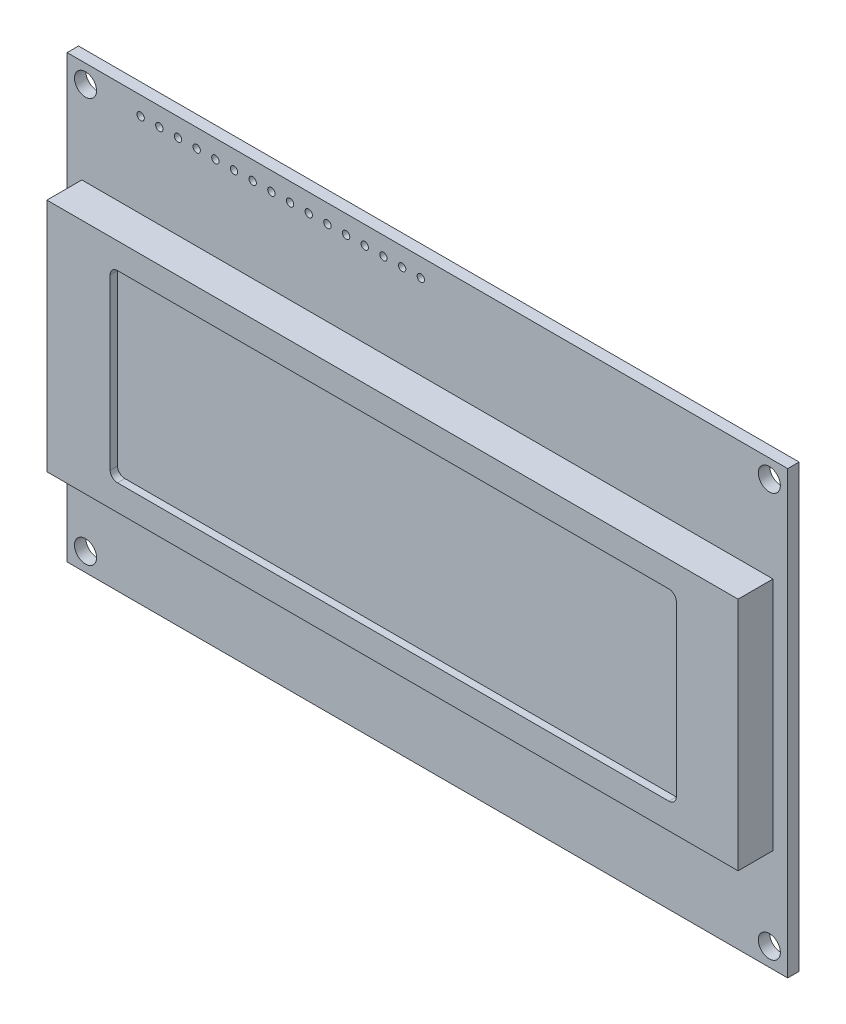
ISO-10303-21;
HEADER;
FILE_DESCRIPTION(('STEP AP214'),'2;1');
FILE_NAME('part.step','',(''),(''),'','','');
FILE_SCHEMA(('AUTOMOTIVE_DESIGN { 1 0 10303 214 1 1 1 1 }'));
ENDSEC;
DATA;
#1=APPLICATION_CONTEXT('core data for automotive mechanical design processes');
#2=APPLICATION_PROTOCOL_DEFINITION('international standard','automotive_design',2000,#1);
#3=PRODUCT_CONTEXT('',#1,'mechanical');
#4=PRODUCT('Part','Part','',(#3));
#5=PRODUCT_RELATED_PRODUCT_CATEGORY('part','',(#4));
#6=PRODUCT_DEFINITION_FORMATION('','',#4);
#7=PRODUCT_DEFINITION_CONTEXT('part definition',#1,'design');
#8=PRODUCT_DEFINITION('design','',#6,#7);
#9=PRODUCT_DEFINITION_SHAPE('','',#8);
#10=(LENGTH_UNIT() NAMED_UNIT(*) SI_UNIT(.MILLI.,.METRE.));
#11=(NAMED_UNIT(*) PLANE_ANGLE_UNIT() SI_UNIT($,.RADIAN.));
#12=(NAMED_UNIT(*) SI_UNIT($,.STERADIAN.) SOLID_ANGLE_UNIT());
#13=UNCERTAINTY_MEASURE_WITH_UNIT(LENGTH_MEASURE(1.E-05),#10,'distance_accuracy_value','');
#14=(GEOMETRIC_REPRESENTATION_CONTEXT(3) GLOBAL_UNCERTAINTY_ASSIGNED_CONTEXT((#13)) GLOBAL_UNIT_ASSIGNED_CONTEXT((#10,
#11,#12)) REPRESENTATION_CONTEXT('',''));
#15=CARTESIAN_POINT('',(0.,0.,0.));
#16=DIRECTION('',(0.,0.,1.));
#17=DIRECTION('',(1.,0.,0.));
#18=AXIS2_PLACEMENT_3D('',#15,#16,#17);
#19=CARTESIAN_POINT('',(0.,0.,1.55));
#20=DIRECTION('',(0.,0.,1.));
#21=DIRECTION('',(1.,0.,0.));
#22=AXIS2_PLACEMENT_3D('',#19,#20,#21);
#23=PLANE('',#22);
#24=CARTESIAN_POINT('',(-14.800836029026,29.4904983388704,1.55));
#25=DIRECTION('',(0.,0.,1.));
#26=DIRECTION('',(1.,0.,0.));
#27=AXIS2_PLACEMENT_3D('',#24,#25,#26);
#28=CIRCLE('',#27,0.499999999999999);
#29=CARTESIAN_POINT('',(-14.300836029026,29.4904983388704,1.55));
#30=VERTEX_POINT('',#29);
#31=EDGE_CURVE('E251',#30,#30,#28,.T.);
#32=ORIENTED_EDGE('',*,*,#31,.F.);
#33=EDGE_LOOP('',(#32));
#34=FACE_BOUND('',#33,.T.);
#35=CARTESIAN_POINT('',(-19.880836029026,29.4904983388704,1.55));
#36=DIRECTION('',(0.,0.,1.));
#37=DIRECTION('',(1.,0.,0.));
#38=AXIS2_PLACEMENT_3D('',#35,#36,#37);
#39=CIRCLE('',#38,0.499999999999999);
#40=CARTESIAN_POINT('',(-19.380836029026,29.4904983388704,1.55));
#41=VERTEX_POINT('',#40);
#42=EDGE_CURVE('E263',#41,#41,#39,.T.);
#43=ORIENTED_EDGE('',*,*,#42,.F.);
#44=EDGE_LOOP('',(#43));
#45=FACE_BOUND('',#44,.T.);
#46=CARTESIAN_POINT('',(-24.960836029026,29.4904983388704,1.55));
#47=DIRECTION('',(0.,0.,1.));
#48=DIRECTION('',(1.,0.,0.));
#49=AXIS2_PLACEMENT_3D('',#46,#47,#48);
#50=CIRCLE('',#49,0.499999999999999);
#51=CARTESIAN_POINT('',(-24.460836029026,29.4904983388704,1.55));
#52=VERTEX_POINT('',#51);
#53=EDGE_CURVE('E275',#52,#52,#50,.T.);
#54=ORIENTED_EDGE('',*,*,#53,.F.);
#55=EDGE_LOOP('',(#54));
#56=FACE_BOUND('',#55,.T.);
#57=CARTESIAN_POINT('',(-30.040836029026,29.4904983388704,1.55));
#58=DIRECTION('',(0.,0.,1.));
#59=DIRECTION('',(1.,0.,0.));
#60=AXIS2_PLACEMENT_3D('',#57,#58,#59);
#61=CIRCLE('',#60,0.499999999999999);
#62=CARTESIAN_POINT('',(-29.540836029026,29.4904983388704,1.55));
#63=VERTEX_POINT('',#62);
#64=EDGE_CURVE('E287',#63,#63,#61,.T.);
#65=ORIENTED_EDGE('',*,*,#64,.F.);
#66=EDGE_LOOP('',(#65));
#67=FACE_BOUND('',#66,.T.);
#68=CARTESIAN_POINT('',(-35.1208360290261,29.4904983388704,1.55));
#69=DIRECTION('',(0.,0.,1.));
#70=DIRECTION('',(1.,0.,0.));
#71=AXIS2_PLACEMENT_3D('',#68,#69,#70);
#72=CIRCLE('',#71,0.499999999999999);
#73=CARTESIAN_POINT('',(-34.620836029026,29.4904983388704,1.55));
#74=VERTEX_POINT('',#73);
#75=EDGE_CURVE('E299',#74,#74,#72,.T.);
#76=ORIENTED_EDGE('',*,*,#75,.F.);
#77=EDGE_LOOP('',(#76));
#78=FACE_BOUND('',#77,.T.);
#79=CARTESIAN_POINT('',(-40.200836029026,29.4904983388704,1.55));
#80=DIRECTION('',(0.,0.,1.));
#81=DIRECTION('',(1.,0.,0.));
#82=AXIS2_PLACEMENT_3D('',#79,#80,#81);
#83=CIRCLE('',#82,0.499999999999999);
#84=CARTESIAN_POINT('',(-39.700836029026,29.4904983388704,1.55));
#85=VERTEX_POINT('',#84);
#86=EDGE_CURVE('E311',#85,#85,#83,.T.);
#87=ORIENTED_EDGE('',*,*,#86,.F.);
#88=EDGE_LOOP('',(#87));
#89=FACE_BOUND('',#88,.T.);
#90=CARTESIAN_POINT('',(-45.280836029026,29.4904983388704,1.55));
#91=DIRECTION('',(0.,0.,1.));
#92=DIRECTION('',(1.,0.,0.));
#93=AXIS2_PLACEMENT_3D('',#90,#91,#92);
#94=CIRCLE('',#93,0.499999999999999);
#95=CARTESIAN_POINT('',(-44.780836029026,29.4904983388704,1.55));
#96=VERTEX_POINT('',#95);
#97=EDGE_CURVE('E323',#96,#96,#94,.T.);
#98=ORIENTED_EDGE('',*,*,#97,.F.);
#99=EDGE_LOOP('',(#98));
#100=FACE_BOUND('',#99,.T.);
#101=CARTESIAN_POINT('',(-50.360836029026,29.4904983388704,1.55));
#102=DIRECTION('',(0.,0.,1.));
#103=DIRECTION('',(1.,0.,0.));
#104=AXIS2_PLACEMENT_3D('',#101,#102,#103);
#105=CIRCLE('',#104,0.499999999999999);
#106=CARTESIAN_POINT('',(-49.860836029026,29.4904983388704,1.55));
#107=VERTEX_POINT('',#106);
#108=EDGE_CURVE('E335',#107,#107,#105,.T.);
#109=ORIENTED_EDGE('',*,*,#108,.F.);
#110=EDGE_LOOP('',(#109));
#111=FACE_BOUND('',#110,.T.);
#112=CARTESIAN_POINT('',(-60.400836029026,-25.5095016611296,1.55));
#113=DIRECTION('',(0.,0.,1.));
#114=DIRECTION('',(-1.,0.,0.));
#115=AXIS2_PLACEMENT_3D('',#112,#113,#114);
#116=CIRCLE('',#115,1.5);
#117=CARTESIAN_POINT('',(-61.900836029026,-25.5095016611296,1.55));
#118=VERTEX_POINT('',#117);
#119=EDGE_CURVE('E347',#118,#118,#116,.T.);
#120=ORIENTED_EDGE('',*,*,#119,.F.);
#121=EDGE_LOOP('',(#120));
#122=FACE_BOUND('',#121,.T.);
#123=CARTESIAN_POINT('',(32.599163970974,29.4904983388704,1.55));
#124=DIRECTION('',(0.,0.,1.));
#125=DIRECTION('',(-1.,0.,0.));
#126=AXIS2_PLACEMENT_3D('',#123,#124,#125);
#127=CIRCLE('',#126,1.5);
#128=CARTESIAN_POINT('',(31.099163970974,29.4904983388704,1.55));
#129=VERTEX_POINT('',#128);
#130=EDGE_CURVE('E359',#129,#129,#127,.T.);
#131=ORIENTED_EDGE('',*,*,#130,.F.);
#132=EDGE_LOOP('',(#131));
#133=FACE_BOUND('',#132,.T.);
#134=DIRECTION('',(0.,-1.,0.));
#135=VECTOR('',#134,1.);
#136=CARTESIAN_POINT('',(-62.900836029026,31.9904983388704,1.55));
#137=LINE('',#136,#135);
#138=CARTESIAN_POINT('',(-62.900836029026,31.9904983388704,1.55));
#139=VERTEX_POINT('',#138);
#140=CARTESIAN_POINT('',(-62.900836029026,-28.0095016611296,1.55));
#141=VERTEX_POINT('',#140);
#142=EDGE_CURVE('E371',#139,#141,#137,.T.);
#143=ORIENTED_EDGE('',*,*,#142,.T.);
#144=DIRECTION('',(1.,0.,0.));
#145=VECTOR('',#144,1.);
#146=CARTESIAN_POINT('',(-62.900836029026,-28.0095016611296,1.55));
#147=LINE('',#146,#145);
#148=CARTESIAN_POINT('',(35.099163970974,-28.0095016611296,1.55));
#149=VERTEX_POINT('',#148);
#150=EDGE_CURVE('E374',#141,#149,#147,.T.);
#151=ORIENTED_EDGE('',*,*,#150,.T.);
#152=DIRECTION('',(0.,1.,0.));
#153=VECTOR('',#152,1.);
#154=CARTESIAN_POINT('',(35.099163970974,31.9904983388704,1.55));
#155=LINE('',#154,#153);
#156=CARTESIAN_POINT('',(35.099163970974,31.9904983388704,1.55));
#157=VERTEX_POINT('',#156);
#158=EDGE_CURVE('E377',#149,#157,#155,.T.);
#159=ORIENTED_EDGE('',*,*,#158,.T.);
#160=DIRECTION('',(-1.,0.,0.));
#161=VECTOR('',#160,1.);
#162=CARTESIAN_POINT('',(-62.900836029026,31.9904983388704,1.55));
#163=LINE('',#162,#161);
#164=EDGE_CURVE('E379',#157,#139,#163,.T.);
#165=ORIENTED_EDGE('',*,*,#164,.T.);
#166=EDGE_LOOP('',(#143,#151,#159,#165));
#167=FACE_BOUND('',#166,.T.);
#168=CARTESIAN_POINT('',(-60.400836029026,29.4904983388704,1.55));
#169=DIRECTION('',(0.,0.,1.));
#170=DIRECTION('',(1.,0.,0.));
#171=AXIS2_PLACEMENT_3D('',#168,#169,#170);
#172=CIRCLE('',#171,1.5);
#173=CARTESIAN_POINT('',(-61.900836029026,29.4904983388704,1.55));
#174=VERTEX_POINT('',#173);
#175=EDGE_CURVE('E365',#174,#174,#172,.T.);
#176=ORIENTED_EDGE('',*,*,#175,.F.);
#177=EDGE_LOOP('',(#176));
#178=FACE_BOUND('',#177,.T.);
#179=CARTESIAN_POINT('',(32.599163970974,-25.5095016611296,1.55));
#180=DIRECTION('',(0.,0.,1.));
#181=DIRECTION('',(1.,0.,0.));
#182=AXIS2_PLACEMENT_3D('',#179,#180,#181);
#183=CIRCLE('',#182,1.5);
#184=CARTESIAN_POINT('',(31.099163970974,-25.5095016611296,1.55));
#185=VERTEX_POINT('',#184);
#186=EDGE_CURVE('E353',#185,#185,#183,.T.);
#187=ORIENTED_EDGE('',*,*,#186,.F.);
#188=EDGE_LOOP('',(#187));
#189=FACE_BOUND('',#188,.T.);
#190=CARTESIAN_POINT('',(-52.900836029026,29.4904983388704,1.55));
#191=DIRECTION('',(0.,0.,1.));
#192=DIRECTION('',(1.,0.,0.));
#193=AXIS2_PLACEMENT_3D('',#190,#191,#192);
#194=CIRCLE('',#193,0.499999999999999);
#195=CARTESIAN_POINT('',(-52.400836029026,29.4904983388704,1.55));
#196=VERTEX_POINT('',#195);
#197=EDGE_CURVE('E341',#196,#196,#194,.T.);
#198=ORIENTED_EDGE('',*,*,#197,.F.);
#199=EDGE_LOOP('',(#198));
#200=FACE_BOUND('',#199,.T.);
#201=CARTESIAN_POINT('',(-47.820836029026,29.4904983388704,1.55));
#202=DIRECTION('',(0.,0.,1.));
#203=DIRECTION('',(1.,0.,0.));
#204=AXIS2_PLACEMENT_3D('',#201,#202,#203);
#205=CIRCLE('',#204,0.499999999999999);
#206=CARTESIAN_POINT('',(-47.320836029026,29.4904983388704,1.55));
#207=VERTEX_POINT('',#206);
#208=EDGE_CURVE('E329',#207,#207,#205,.T.);
#209=ORIENTED_EDGE('',*,*,#208,.F.);
#210=EDGE_LOOP('',(#209));
#211=FACE_BOUND('',#210,.T.);
#212=CARTESIAN_POINT('',(-42.740836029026,29.4904983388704,1.55));
#213=DIRECTION('',(0.,0.,1.));
#214=DIRECTION('',(1.,0.,0.));
#215=AXIS2_PLACEMENT_3D('',#212,#213,#214);
#216=CIRCLE('',#215,0.499999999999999);
#217=CARTESIAN_POINT('',(-42.240836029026,29.4904983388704,1.55));
#218=VERTEX_POINT('',#217);
#219=EDGE_CURVE('E317',#218,#218,#216,.T.);
#220=ORIENTED_EDGE('',*,*,#219,.F.);
#221=EDGE_LOOP('',(#220));
#222=FACE_BOUND('',#221,.T.);
#223=CARTESIAN_POINT('',(-37.6608360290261,29.4904983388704,1.55));
#224=DIRECTION('',(0.,0.,1.));
#225=DIRECTION('',(1.,0.,0.));
#226=AXIS2_PLACEMENT_3D('',#223,#224,#225);
#227=CIRCLE('',#226,0.499999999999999);
#228=CARTESIAN_POINT('',(-37.1608360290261,29.4904983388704,1.55));
#229=VERTEX_POINT('',#228);
#230=EDGE_CURVE('E305',#229,#229,#227,.T.);
#231=ORIENTED_EDGE('',*,*,#230,.F.);
#232=EDGE_LOOP('',(#231));
#233=FACE_BOUND('',#232,.T.);
#234=CARTESIAN_POINT('',(-32.580836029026,29.4904983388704,1.55));
#235=DIRECTION('',(0.,0.,1.));
#236=DIRECTION('',(1.,0.,0.));
#237=AXIS2_PLACEMENT_3D('',#234,#235,#236);
#238=CIRCLE('',#237,0.499999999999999);
#239=CARTESIAN_POINT('',(-32.080836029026,29.4904983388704,1.55));
#240=VERTEX_POINT('',#239);
#241=EDGE_CURVE('E293',#240,#240,#238,.T.);
#242=ORIENTED_EDGE('',*,*,#241,.F.);
#243=EDGE_LOOP('',(#242));
#244=FACE_BOUND('',#243,.T.);
#245=CARTESIAN_POINT('',(-27.500836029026,29.4904983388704,1.55));
#246=DIRECTION('',(0.,0.,1.));
#247=DIRECTION('',(1.,0.,0.));
#248=AXIS2_PLACEMENT_3D('',#245,#246,#247);
#249=CIRCLE('',#248,0.499999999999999);
#250=CARTESIAN_POINT('',(-27.000836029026,29.4904983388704,1.55));
#251=VERTEX_POINT('',#250);
#252=EDGE_CURVE('E281',#251,#251,#249,.T.);
#253=ORIENTED_EDGE('',*,*,#252,.F.);
#254=EDGE_LOOP('',(#253));
#255=FACE_BOUND('',#254,.T.);
#256=CARTESIAN_POINT('',(-22.420836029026,29.4904983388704,1.55));
#257=DIRECTION('',(0.,0.,1.));
#258=DIRECTION('',(1.,0.,0.));
#259=AXIS2_PLACEMENT_3D('',#256,#257,#258);
#260=CIRCLE('',#259,0.499999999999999);
#261=CARTESIAN_POINT('',(-21.920836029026,29.4904983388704,1.55));
#262=VERTEX_POINT('',#261);
#263=EDGE_CURVE('E269',#262,#262,#260,.T.);
#264=ORIENTED_EDGE('',*,*,#263,.F.);
#265=EDGE_LOOP('',(#264));
#266=FACE_BOUND('',#265,.T.);
#267=CARTESIAN_POINT('',(-17.340836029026,29.4904983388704,1.55));
#268=DIRECTION('',(0.,0.,1.));
#269=DIRECTION('',(1.,0.,0.));
#270=AXIS2_PLACEMENT_3D('',#267,#268,#269);
#271=CIRCLE('',#270,0.499999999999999);
#272=CARTESIAN_POINT('',(-16.840836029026,29.4904983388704,1.55));
#273=VERTEX_POINT('',#272);
#274=EDGE_CURVE('E257',#273,#273,#271,.T.);
#275=ORIENTED_EDGE('',*,*,#274,.F.);
#276=EDGE_LOOP('',(#275));
#277=FACE_BOUND('',#276,.T.);
#278=DIRECTION('',(1.,0.,0.));
#279=VECTOR('',#278,1.);
#280=CARTESIAN_POINT('',(-60.900836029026,-14.0095016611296,1.55));
#281=LINE('',#280,#279);
#282=CARTESIAN_POINT('',(-60.900836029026,-14.0095016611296,1.55));
#283=VERTEX_POINT('',#282);
#284=CARTESIAN_POINT('',(33.099163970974,-14.0095016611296,1.55));
#285=VERTEX_POINT('',#284);
#286=EDGE_CURVE('E237',#283,#285,#281,.T.);
#287=ORIENTED_EDGE('',*,*,#286,.F.);
#288=DIRECTION('',(0.,-1.,0.));
#289=VECTOR('',#288,1.);
#290=CARTESIAN_POINT('',(-60.900836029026,17.9904983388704,1.55));
#291=LINE('',#290,#289);
#292=CARTESIAN_POINT('',(-60.900836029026,17.9904983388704,1.55));
#293=VERTEX_POINT('',#292);
#294=EDGE_CURVE('E212',#293,#283,#291,.T.);
#295=ORIENTED_EDGE('',*,*,#294,.F.);
#296=DIRECTION('',(-1.,0.,0.));
#297=VECTOR('',#296,1.);
#298=CARTESIAN_POINT('',(-60.900836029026,17.9904983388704,1.55));
#299=LINE('',#298,#297);
#300=CARTESIAN_POINT('',(33.099163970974,17.9904983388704,1.55));
#301=VERTEX_POINT('',#300);
#302=EDGE_CURVE('E228',#301,#293,#299,.T.);
#303=ORIENTED_EDGE('',*,*,#302,.F.);
#304=DIRECTION('',(0.,1.,0.));
#305=VECTOR('',#304,1.);
#306=CARTESIAN_POINT('',(33.099163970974,17.9904983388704,1.55));
#307=LINE('',#306,#305);
#308=EDGE_CURVE('E239',#285,#301,#307,.T.);
#309=ORIENTED_EDGE('',*,*,#308,.F.);
#310=EDGE_LOOP('',(#287,#295,#303,#309));
#311=FACE_BOUND('',#310,.T.);
#312=ADVANCED_FACE('F39',(#34,#45,#56,#67,#78,#89,#100,#111,#122,#133,#167,#178,#189,#200,#211,
#222,#233,#244,#255,#266,#277,#311),#23,.T.);
#313=CARTESIAN_POINT('',(0.,0.,0.));
#314=DIRECTION('',(0.,0.,1.));
#315=DIRECTION('',(1.,0.,0.));
#316=AXIS2_PLACEMENT_3D('',#313,#314,#315);
#317=PLANE('',#316);
#318=CARTESIAN_POINT('',(-17.340836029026,29.4904983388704,0.));
#319=DIRECTION('',(0.,0.,1.));
#320=DIRECTION('',(1.,0.,0.));
#321=AXIS2_PLACEMENT_3D('',#318,#319,#320);
#322=CIRCLE('',#321,0.499999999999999);
#323=CARTESIAN_POINT('',(-16.840836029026,29.4904983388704,0.));
#324=VERTEX_POINT('',#323);
#325=EDGE_CURVE('E254',#324,#324,#322,.T.);
#326=ORIENTED_EDGE('',*,*,#325,.T.);
#327=EDGE_LOOP('',(#326));
#328=FACE_BOUND('',#327,.T.);
#329=CARTESIAN_POINT('',(-22.420836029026,29.4904983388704,0.));
#330=DIRECTION('',(0.,0.,1.));
#331=DIRECTION('',(1.,0.,0.));
#332=AXIS2_PLACEMENT_3D('',#329,#330,#331);
#333=CIRCLE('',#332,0.499999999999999);
#334=CARTESIAN_POINT('',(-21.920836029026,29.4904983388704,0.));
#335=VERTEX_POINT('',#334);
#336=EDGE_CURVE('E266',#335,#335,#333,.T.);
#337=ORIENTED_EDGE('',*,*,#336,.T.);
#338=EDGE_LOOP('',(#337));
#339=FACE_BOUND('',#338,.T.);
#340=CARTESIAN_POINT('',(-27.500836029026,29.4904983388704,0.));
#341=DIRECTION('',(0.,0.,1.));
#342=DIRECTION('',(1.,0.,0.));
#343=AXIS2_PLACEMENT_3D('',#340,#341,#342);
#344=CIRCLE('',#343,0.499999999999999);
#345=CARTESIAN_POINT('',(-27.000836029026,29.4904983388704,0.));
#346=VERTEX_POINT('',#345);
#347=EDGE_CURVE('E278',#346,#346,#344,.T.);
#348=ORIENTED_EDGE('',*,*,#347,.T.);
#349=EDGE_LOOP('',(#348));
#350=FACE_BOUND('',#349,.T.);
#351=CARTESIAN_POINT('',(-32.580836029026,29.4904983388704,0.));
#352=DIRECTION('',(0.,0.,1.));
#353=DIRECTION('',(1.,0.,0.));
#354=AXIS2_PLACEMENT_3D('',#351,#352,#353);
#355=CIRCLE('',#354,0.499999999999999);
#356=CARTESIAN_POINT('',(-32.080836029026,29.4904983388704,0.));
#357=VERTEX_POINT('',#356);
#358=EDGE_CURVE('E290',#357,#357,#355,.T.);
#359=ORIENTED_EDGE('',*,*,#358,.T.);
#360=EDGE_LOOP('',(#359));
#361=FACE_BOUND('',#360,.T.);
#362=CARTESIAN_POINT('',(-37.6608360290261,29.4904983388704,0.));
#363=DIRECTION('',(0.,0.,1.));
#364=DIRECTION('',(1.,0.,0.));
#365=AXIS2_PLACEMENT_3D('',#362,#363,#364);
#366=CIRCLE('',#365,0.499999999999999);
#367=CARTESIAN_POINT('',(-37.1608360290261,29.4904983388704,0.));
#368=VERTEX_POINT('',#367);
#369=EDGE_CURVE('E302',#368,#368,#366,.T.);
#370=ORIENTED_EDGE('',*,*,#369,.T.);
#371=EDGE_LOOP('',(#370));
#372=FACE_BOUND('',#371,.T.);
#373=CARTESIAN_POINT('',(-42.740836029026,29.4904983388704,0.));
#374=DIRECTION('',(0.,0.,1.));
#375=DIRECTION('',(1.,0.,0.));
#376=AXIS2_PLACEMENT_3D('',#373,#374,#375);
#377=CIRCLE('',#376,0.499999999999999);
#378=CARTESIAN_POINT('',(-42.240836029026,29.4904983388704,0.));
#379=VERTEX_POINT('',#378);
#380=EDGE_CURVE('E314',#379,#379,#377,.T.);
#381=ORIENTED_EDGE('',*,*,#380,.T.);
#382=EDGE_LOOP('',(#381));
#383=FACE_BOUND('',#382,.T.);
#384=CARTESIAN_POINT('',(-47.820836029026,29.4904983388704,0.));
#385=DIRECTION('',(0.,0.,1.));
#386=DIRECTION('',(1.,0.,0.));
#387=AXIS2_PLACEMENT_3D('',#384,#385,#386);
#388=CIRCLE('',#387,0.499999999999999);
#389=CARTESIAN_POINT('',(-47.320836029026,29.4904983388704,0.));
#390=VERTEX_POINT('',#389);
#391=EDGE_CURVE('E326',#390,#390,#388,.T.);
#392=ORIENTED_EDGE('',*,*,#391,.T.);
#393=EDGE_LOOP('',(#392));
#394=FACE_BOUND('',#393,.T.);
#395=CARTESIAN_POINT('',(-52.900836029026,29.4904983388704,0.));
#396=DIRECTION('',(0.,0.,1.));
#397=DIRECTION('',(1.,0.,0.));
#398=AXIS2_PLACEMENT_3D('',#395,#396,#397);
#399=CIRCLE('',#398,0.499999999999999);
#400=CARTESIAN_POINT('',(-52.400836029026,29.4904983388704,0.));
#401=VERTEX_POINT('',#400);
#402=EDGE_CURVE('E338',#401,#401,#399,.T.);
#403=ORIENTED_EDGE('',*,*,#402,.T.);
#404=EDGE_LOOP('',(#403));
#405=FACE_BOUND('',#404,.T.);
#406=CARTESIAN_POINT('',(32.599163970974,-25.5095016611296,0.));
#407=DIRECTION('',(0.,0.,1.));
#408=DIRECTION('',(1.,0.,0.));
#409=AXIS2_PLACEMENT_3D('',#406,#407,#408);
#410=CIRCLE('',#409,1.5);
#411=CARTESIAN_POINT('',(31.099163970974,-25.5095016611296,0.));
#412=VERTEX_POINT('',#411);
#413=EDGE_CURVE('E350',#412,#412,#410,.T.);
#414=ORIENTED_EDGE('',*,*,#413,.T.);
#415=EDGE_LOOP('',(#414));
#416=FACE_BOUND('',#415,.T.);
#417=CARTESIAN_POINT('',(-60.400836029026,29.4904983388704,0.));
#418=DIRECTION('',(0.,0.,1.));
#419=DIRECTION('',(1.,0.,0.));
#420=AXIS2_PLACEMENT_3D('',#417,#418,#419);
#421=CIRCLE('',#420,1.5);
#422=CARTESIAN_POINT('',(-61.900836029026,29.4904983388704,0.));
#423=VERTEX_POINT('',#422);
#424=EDGE_CURVE('E362',#423,#423,#421,.T.);
#425=ORIENTED_EDGE('',*,*,#424,.T.);
#426=EDGE_LOOP('',(#425));
#427=FACE_BOUND('',#426,.T.);
#428=DIRECTION('',(0.,-1.,0.));
#429=VECTOR('',#428,1.);
#430=CARTESIAN_POINT('',(-62.900836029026,31.9904983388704,0.));
#431=LINE('',#430,#429);
#432=CARTESIAN_POINT('',(-62.900836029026,31.9904983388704,0.));
#433=VERTEX_POINT('',#432);
#434=CARTESIAN_POINT('',(-62.900836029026,-28.0095016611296,0.));
#435=VERTEX_POINT('',#434);
#436=EDGE_CURVE('E368',#433,#435,#431,.T.);
#437=ORIENTED_EDGE('',*,*,#436,.F.);
#438=DIRECTION('',(-1.,0.,0.));
#439=VECTOR('',#438,1.);
#440=CARTESIAN_POINT('',(-62.900836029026,31.9904983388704,0.));
#441=LINE('',#440,#439);
#442=CARTESIAN_POINT('',(35.099163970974,31.9904983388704,0.));
#443=VERTEX_POINT('',#442);
#444=EDGE_CURVE('E375',#443,#433,#441,.T.);
#445=ORIENTED_EDGE('',*,*,#444,.F.);
#446=DIRECTION('',(0.,1.,0.));
#447=VECTOR('',#446,1.);
#448=CARTESIAN_POINT('',(35.099163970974,31.9904983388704,0.));
#449=LINE('',#448,#447);
#450=CARTESIAN_POINT('',(35.099163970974,-28.0095016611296,0.));
#451=VERTEX_POINT('',#450);
#452=EDGE_CURVE('E386',#451,#443,#449,.T.);
#453=ORIENTED_EDGE('',*,*,#452,.F.);
#454=DIRECTION('',(1.,0.,0.));
#455=VECTOR('',#454,1.);
#456=CARTESIAN_POINT('',(-62.900836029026,-28.0095016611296,0.));
#457=LINE('',#456,#455);
#458=EDGE_CURVE('E384',#435,#451,#457,.T.);
#459=ORIENTED_EDGE('',*,*,#458,.F.);
#460=EDGE_LOOP('',(#437,#445,#453,#459));
#461=FACE_BOUND('',#460,.T.);
#462=CARTESIAN_POINT('',(32.599163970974,29.4904983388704,0.));
#463=DIRECTION('',(0.,0.,1.));
#464=DIRECTION('',(-1.,0.,0.));
#465=AXIS2_PLACEMENT_3D('',#462,#463,#464);
#466=CIRCLE('',#465,1.5);
#467=CARTESIAN_POINT('',(31.099163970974,29.4904983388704,0.));
#468=VERTEX_POINT('',#467);
#469=EDGE_CURVE('E356',#468,#468,#466,.T.);
#470=ORIENTED_EDGE('',*,*,#469,.T.);
#471=EDGE_LOOP('',(#470));
#472=FACE_BOUND('',#471,.T.);
#473=CARTESIAN_POINT('',(-60.400836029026,-25.5095016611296,0.));
#474=DIRECTION('',(0.,0.,1.));
#475=DIRECTION('',(-1.,0.,0.));
#476=AXIS2_PLACEMENT_3D('',#473,#474,#475);
#477=CIRCLE('',#476,1.5);
#478=CARTESIAN_POINT('',(-61.900836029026,-25.5095016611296,0.));
#479=VERTEX_POINT('',#478);
#480=EDGE_CURVE('E344',#479,#479,#477,.T.);
#481=ORIENTED_EDGE('',*,*,#480,.T.);
#482=EDGE_LOOP('',(#481));
#483=FACE_BOUND('',#482,.T.);
#484=CARTESIAN_POINT('',(-50.360836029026,29.4904983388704,0.));
#485=DIRECTION('',(0.,0.,1.));
#486=DIRECTION('',(1.,0.,0.));
#487=AXIS2_PLACEMENT_3D('',#484,#485,#486);
#488=CIRCLE('',#487,0.499999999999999);
#489=CARTESIAN_POINT('',(-49.860836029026,29.4904983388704,0.));
#490=VERTEX_POINT('',#489);
#491=EDGE_CURVE('E332',#490,#490,#488,.T.);
#492=ORIENTED_EDGE('',*,*,#491,.T.);
#493=EDGE_LOOP('',(#492));
#494=FACE_BOUND('',#493,.T.);
#495=CARTESIAN_POINT('',(-45.280836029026,29.4904983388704,0.));
#496=DIRECTION('',(0.,0.,1.));
#497=DIRECTION('',(1.,0.,0.));
#498=AXIS2_PLACEMENT_3D('',#495,#496,#497);
#499=CIRCLE('',#498,0.499999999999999);
#500=CARTESIAN_POINT('',(-44.780836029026,29.4904983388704,0.));
#501=VERTEX_POINT('',#500);
#502=EDGE_CURVE('E320',#501,#501,#499,.T.);
#503=ORIENTED_EDGE('',*,*,#502,.T.);
#504=EDGE_LOOP('',(#503));
#505=FACE_BOUND('',#504,.T.);
#506=CARTESIAN_POINT('',(-40.200836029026,29.4904983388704,0.));
#507=DIRECTION('',(0.,0.,1.));
#508=DIRECTION('',(1.,0.,0.));
#509=AXIS2_PLACEMENT_3D('',#506,#507,#508);
#510=CIRCLE('',#509,0.499999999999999);
#511=CARTESIAN_POINT('',(-39.700836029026,29.4904983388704,0.));
#512=VERTEX_POINT('',#511);
#513=EDGE_CURVE('E308',#512,#512,#510,.T.);
#514=ORIENTED_EDGE('',*,*,#513,.T.);
#515=EDGE_LOOP('',(#514));
#516=FACE_BOUND('',#515,.T.);
#517=CARTESIAN_POINT('',(-35.1208360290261,29.4904983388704,0.));
#518=DIRECTION('',(0.,0.,1.));
#519=DIRECTION('',(1.,0.,0.));
#520=AXIS2_PLACEMENT_3D('',#517,#518,#519);
#521=CIRCLE('',#520,0.499999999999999);
#522=CARTESIAN_POINT('',(-34.620836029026,29.4904983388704,0.));
#523=VERTEX_POINT('',#522);
#524=EDGE_CURVE('E296',#523,#523,#521,.T.);
#525=ORIENTED_EDGE('',*,*,#524,.T.);
#526=EDGE_LOOP('',(#525));
#527=FACE_BOUND('',#526,.T.);
#528=CARTESIAN_POINT('',(-30.040836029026,29.4904983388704,0.));
#529=DIRECTION('',(0.,0.,1.));
#530=DIRECTION('',(1.,0.,0.));
#531=AXIS2_PLACEMENT_3D('',#528,#529,#530);
#532=CIRCLE('',#531,0.499999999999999);
#533=CARTESIAN_POINT('',(-29.540836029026,29.4904983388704,0.));
#534=VERTEX_POINT('',#533);
#535=EDGE_CURVE('E284',#534,#534,#532,.T.);
#536=ORIENTED_EDGE('',*,*,#535,.T.);
#537=EDGE_LOOP('',(#536));
#538=FACE_BOUND('',#537,.T.);
#539=CARTESIAN_POINT('',(-24.960836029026,29.4904983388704,0.));
#540=DIRECTION('',(0.,0.,1.));
#541=DIRECTION('',(1.,0.,0.));
#542=AXIS2_PLACEMENT_3D('',#539,#540,#541);
#543=CIRCLE('',#542,0.499999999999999);
#544=CARTESIAN_POINT('',(-24.460836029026,29.4904983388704,0.));
#545=VERTEX_POINT('',#544);
#546=EDGE_CURVE('E272',#545,#545,#543,.T.);
#547=ORIENTED_EDGE('',*,*,#546,.T.);
#548=EDGE_LOOP('',(#547));
#549=FACE_BOUND('',#548,.T.);
#550=CARTESIAN_POINT('',(-19.880836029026,29.4904983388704,0.));
#551=DIRECTION('',(0.,0.,1.));
#552=DIRECTION('',(1.,0.,0.));
#553=AXIS2_PLACEMENT_3D('',#550,#551,#552);
#554=CIRCLE('',#553,0.499999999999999);
#555=CARTESIAN_POINT('',(-19.380836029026,29.4904983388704,0.));
#556=VERTEX_POINT('',#555);
#557=EDGE_CURVE('E260',#556,#556,#554,.T.);
#558=ORIENTED_EDGE('',*,*,#557,.T.);
#559=EDGE_LOOP('',(#558));
#560=FACE_BOUND('',#559,.T.);
#561=CARTESIAN_POINT('',(-14.800836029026,29.4904983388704,0.));
#562=DIRECTION('',(0.,0.,1.));
#563=DIRECTION('',(1.,0.,0.));
#564=AXIS2_PLACEMENT_3D('',#561,#562,#563);
#565=CIRCLE('',#564,0.499999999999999);
#566=CARTESIAN_POINT('',(-14.300836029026,29.4904983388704,0.));
#567=VERTEX_POINT('',#566);
#568=EDGE_CURVE('E250',#567,#567,#565,.T.);
#569=ORIENTED_EDGE('',*,*,#568,.T.);
#570=EDGE_LOOP('',(#569));
#571=FACE_BOUND('',#570,.T.);
#572=ADVANCED_FACE('F404',(#328,#339,#350,#361,#372,#383,#394,#405,#416,#427,#461,#472,#483,
#494,#505,#516,#527,#538,#549,#560,#571),#317,.F.);
#573=CARTESIAN_POINT('',(-62.900836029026,31.9904983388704,1.55));
#574=DIRECTION('',(1.,0.,0.));
#575=DIRECTION('',(0.,1.,0.));
#576=AXIS2_PLACEMENT_3D('',#573,#574,#575);
#577=PLANE('',#576);
#578=ORIENTED_EDGE('',*,*,#436,.T.);
#579=DIRECTION('',(0.,0.,-1.));
#580=VECTOR('',#579,1.);
#581=CARTESIAN_POINT('',(-62.900836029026,-28.0095016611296,1.55));
#582=LINE('',#581,#580);
#583=EDGE_CURVE('E11',#141,#435,#582,.T.);
#584=ORIENTED_EDGE('',*,*,#583,.F.);
#585=ORIENTED_EDGE('',*,*,#142,.F.);
#586=DIRECTION('',(0.,0.,-1.));
#587=VECTOR('',#586,1.);
#588=CARTESIAN_POINT('',(-62.900836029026,31.9904983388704,1.55));
#589=LINE('',#588,#587);
#590=EDGE_CURVE('E381',#139,#433,#589,.T.);
#591=ORIENTED_EDGE('',*,*,#590,.T.);
#592=EDGE_LOOP('',(#578,#584,#585,#591));
#593=FACE_BOUND('',#592,.T.);
#594=ADVANCED_FACE('F41',(#593),#577,.F.);
#595=CARTESIAN_POINT('',(-62.900836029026,-28.0095016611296,1.55));
#596=DIRECTION('',(0.,1.,0.));
#597=DIRECTION('',(0.,0.,1.));
#598=AXIS2_PLACEMENT_3D('',#595,#596,#597);
#599=PLANE('',#598);
#600=ORIENTED_EDGE('',*,*,#458,.T.);
#601=DIRECTION('',(0.,0.,-1.));
#602=VECTOR('',#601,1.);
#603=CARTESIAN_POINT('',(35.099163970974,-28.0095016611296,1.55));
#604=LINE('',#603,#602);
#605=EDGE_CURVE('E47',#149,#451,#604,.T.);
#606=ORIENTED_EDGE('',*,*,#605,.F.);
#607=ORIENTED_EDGE('',*,*,#150,.F.);
#608=ORIENTED_EDGE('',*,*,#583,.T.);
#609=EDGE_LOOP('',(#600,#606,#607,#608));
#610=FACE_BOUND('',#609,.T.);
#611=ADVANCED_FACE('F415',(#610),#599,.F.);
#612=CARTESIAN_POINT('',(35.099163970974,31.9904983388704,1.55));
#613=DIRECTION('',(-1.,0.,0.));
#614=DIRECTION('',(0.,-1.,0.));
#615=AXIS2_PLACEMENT_3D('',#612,#613,#614);
#616=PLANE('',#615);
#617=ORIENTED_EDGE('',*,*,#452,.T.);
#618=DIRECTION('',(0.,0.,-1.));
#619=VECTOR('',#618,1.);
#620=CARTESIAN_POINT('',(35.099163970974,31.9904983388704,1.55));
#621=LINE('',#620,#619);
#622=EDGE_CURVE('E391',#157,#443,#621,.T.);
#623=ORIENTED_EDGE('',*,*,#622,.F.);
#624=ORIENTED_EDGE('',*,*,#158,.F.);
#625=ORIENTED_EDGE('',*,*,#605,.T.);
#626=EDGE_LOOP('',(#617,#623,#624,#625));
#627=FACE_BOUND('',#626,.T.);
#628=ADVANCED_FACE('F398',(#627),#616,.F.);
#629=CARTESIAN_POINT('',(-62.900836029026,31.9904983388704,1.55));
#630=DIRECTION('',(0.,-1.,0.));
#631=DIRECTION('',(0.,0.,-1.));
#632=AXIS2_PLACEMENT_3D('',#629,#630,#631);
#633=PLANE('',#632);
#634=ORIENTED_EDGE('',*,*,#444,.T.);
#635=ORIENTED_EDGE('',*,*,#590,.F.);
#636=ORIENTED_EDGE('',*,*,#164,.F.);
#637=ORIENTED_EDGE('',*,*,#622,.T.);
#638=EDGE_LOOP('',(#634,#635,#636,#637));
#639=FACE_BOUND('',#638,.T.);
#640=ADVANCED_FACE('F408',(#639),#633,.F.);
#641=CARTESIAN_POINT('',(-60.400836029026,29.4904983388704,1.55));
#642=DIRECTION('',(0.,0.,-1.));
#643=DIRECTION('',(-1.,0.,0.));
#644=AXIS2_PLACEMENT_3D('',#641,#642,#643);
#645=CYLINDRICAL_SURFACE('',#644,1.5);
#646=CARTESIAN_POINT('',(-61.900836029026,29.4904983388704,1.55));
#647=CARTESIAN_POINT('',(-61.900836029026,29.4904983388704,1.53385416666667));
#648=CARTESIAN_POINT('',(-61.900836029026,29.4904983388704,1.51770833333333));
#649=CARTESIAN_POINT('',(-61.900836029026,29.4904983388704,1.48541666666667));
#650=CARTESIAN_POINT('',(-61.900836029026,29.4904983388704,1.46927083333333));
#651=CARTESIAN_POINT('',(-61.900836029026,29.4904983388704,1.43697916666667));
#652=CARTESIAN_POINT('',(-61.900836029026,29.4904983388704,1.42083333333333));
#653=CARTESIAN_POINT('',(-61.900836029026,29.4904983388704,1.38854166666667));
#654=CARTESIAN_POINT('',(-61.900836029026,29.4904983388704,1.37239583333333));
#655=CARTESIAN_POINT('',(-61.900836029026,29.4904983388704,1.34010416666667));
#656=CARTESIAN_POINT('',(-61.900836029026,29.4904983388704,1.32395833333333));
#657=CARTESIAN_POINT('',(-61.900836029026,29.4904983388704,1.29166666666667));
#658=CARTESIAN_POINT('',(-61.900836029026,29.4904983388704,1.27552083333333));
#659=CARTESIAN_POINT('',(-61.900836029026,29.4904983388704,1.24322916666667));
#660=CARTESIAN_POINT('',(-61.900836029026,29.4904983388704,1.22708333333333));
#661=CARTESIAN_POINT('',(-61.900836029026,29.4904983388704,1.19479166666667));
#662=CARTESIAN_POINT('',(-61.900836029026,29.4904983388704,1.17864583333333));
#663=CARTESIAN_POINT('',(-61.900836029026,29.4904983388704,1.14635416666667));
#664=CARTESIAN_POINT('',(-61.900836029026,29.4904983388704,1.13020833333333));
#665=CARTESIAN_POINT('',(-61.900836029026,29.4904983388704,1.09791666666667));
#666=CARTESIAN_POINT('',(-61.900836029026,29.4904983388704,1.08177083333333));
#667=CARTESIAN_POINT('',(-61.900836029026,29.4904983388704,1.04947916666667));
#668=CARTESIAN_POINT('',(-61.900836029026,29.4904983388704,1.03333333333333));
#669=CARTESIAN_POINT('',(-61.900836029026,29.4904983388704,1.00104166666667));
#670=CARTESIAN_POINT('',(-61.900836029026,29.4904983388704,0.984895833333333));
#671=CARTESIAN_POINT('',(-61.900836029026,29.4904983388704,0.952604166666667));
#672=CARTESIAN_POINT('',(-61.900836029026,29.4904983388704,0.936458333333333));
#673=CARTESIAN_POINT('',(-61.900836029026,29.4904983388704,0.904166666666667));
#674=CARTESIAN_POINT('',(-61.900836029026,29.4904983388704,0.888020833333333));
#675=CARTESIAN_POINT('',(-61.900836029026,29.4904983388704,0.855729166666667));
#676=CARTESIAN_POINT('',(-61.900836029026,29.4904983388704,0.839583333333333));
#677=CARTESIAN_POINT('',(-61.900836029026,29.4904983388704,0.807291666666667));
#678=CARTESIAN_POINT('',(-61.900836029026,29.4904983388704,0.791145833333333));
#679=CARTESIAN_POINT('',(-61.900836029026,29.4904983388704,0.758854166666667));
#680=CARTESIAN_POINT('',(-61.900836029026,29.4904983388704,0.742708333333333));
#681=CARTESIAN_POINT('',(-61.900836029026,29.4904983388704,0.710416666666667));
#682=CARTESIAN_POINT('',(-61.900836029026,29.4904983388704,0.694270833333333));
#683=CARTESIAN_POINT('',(-61.900836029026,29.4904983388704,0.661979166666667));
#684=CARTESIAN_POINT('',(-61.900836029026,29.4904983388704,0.645833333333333));
#685=CARTESIAN_POINT('',(-61.900836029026,29.4904983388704,0.613541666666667));
#686=CARTESIAN_POINT('',(-61.900836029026,29.4904983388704,0.597395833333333));
#687=CARTESIAN_POINT('',(-61.900836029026,29.4904983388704,0.565104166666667));
#688=CARTESIAN_POINT('',(-61.900836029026,29.4904983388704,0.548958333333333));
#689=CARTESIAN_POINT('',(-61.900836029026,29.4904983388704,0.516666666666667));
#690=CARTESIAN_POINT('',(-61.900836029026,29.4904983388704,0.500520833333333));
#691=CARTESIAN_POINT('',(-61.900836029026,29.4904983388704,0.468229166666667));
#692=CARTESIAN_POINT('',(-61.900836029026,29.4904983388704,0.452083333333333));
#693=CARTESIAN_POINT('',(-61.900836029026,29.4904983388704,0.419791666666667));
#694=CARTESIAN_POINT('',(-61.900836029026,29.4904983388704,0.403645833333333));
#695=CARTESIAN_POINT('',(-61.900836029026,29.4904983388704,0.371354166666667));
#696=CARTESIAN_POINT('',(-61.900836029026,29.4904983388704,0.355208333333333));
#697=CARTESIAN_POINT('',(-61.900836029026,29.4904983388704,0.322916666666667));
#698=CARTESIAN_POINT('',(-61.900836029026,29.4904983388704,0.306770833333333));
#699=CARTESIAN_POINT('',(-61.900836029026,29.4904983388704,0.274479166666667));
#700=CARTESIAN_POINT('',(-61.900836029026,29.4904983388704,0.258333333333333));
#701=CARTESIAN_POINT('',(-61.900836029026,29.4904983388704,0.226041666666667));
#702=CARTESIAN_POINT('',(-61.900836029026,29.4904983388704,0.209895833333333));
#703=CARTESIAN_POINT('',(-61.900836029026,29.4904983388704,0.177604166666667));
#704=CARTESIAN_POINT('',(-61.900836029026,29.4904983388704,0.161458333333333));
#705=CARTESIAN_POINT('',(-61.900836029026,29.4904983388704,0.129166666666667));
#706=CARTESIAN_POINT('',(-61.900836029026,29.4904983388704,0.113020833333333));
#707=CARTESIAN_POINT('',(-61.900836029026,29.4904983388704,0.0807291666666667));
#708=CARTESIAN_POINT('',(-61.900836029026,29.4904983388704,0.0645833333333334));
#709=CARTESIAN_POINT('',(-61.900836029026,29.4904983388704,0.0322916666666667));
#710=CARTESIAN_POINT('',(-61.900836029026,29.4904983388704,0.0161458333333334));
#711=CARTESIAN_POINT('',(-61.900836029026,29.4904983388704,0.));
#712=B_SPLINE_CURVE_WITH_KNOTS('',3,(#646,#647,#648,#649,#650,#651,#652,#653,#654,#655,#656,
#657,#658,#659,#660,#661,#662,#663,#664,#665,#666,#667,#668,#669,#670,#671,#672,#673,#674,#675,
#676,#677,#678,#679,#680,#681,#682,#683,#684,#685,#686,#687,#688,#689,#690,#691,#692,#693,#694,
#695,#696,#697,#698,#699,#700,#701,#702,#703,#704,#705,#706,#707,#708,#709,#710,#711),
.UNSPECIFIED.,.F.,.F.,(4,2,2,2,2,2,2,2,2,2,2,2,2,2,2,2,2,2,2,2,2,2,2,2,2,2,2,2,2,2,2,2,4),(0.,
0.0484374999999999,0.096875,0.1453125,0.19375,0.2421875,0.290625,0.3390625,0.3875,0.4359375,
0.484375,0.5328125,0.58125,0.6296875,0.678125,0.7265625,0.775,0.8234375,0.871875,0.9203125,
0.96875,1.0171875,1.065625,1.1140625,1.1625,1.2109375,1.259375,1.3078125,1.35625,1.4046875,
1.453125,1.5015625,1.55),.UNSPECIFIED.);
#713=EDGE_CURVE('BSEAM433',#174,#423,#712,.T.);
#714=ORIENTED_EDGE('',*,*,#175,.T.);
#715=ORIENTED_EDGE('',*,*,#424,.F.);
#716=ORIENTED_EDGE('',*,*,#713,.T.);
#717=ORIENTED_EDGE('',*,*,#713,.F.);
#718=EDGE_LOOP('',(#714,#716,#715,#717));
#719=FACE_BOUND('',#718,.T.);
#720=ADVANCED_FACE('F433',(#719),#645,.F.);
#721=CARTESIAN_POINT('',(32.599163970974,29.4904983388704,1.55));
#722=DIRECTION('',(0.,0.,-1.));
#723=DIRECTION('',(-1.,0.,0.));
#724=AXIS2_PLACEMENT_3D('',#721,#722,#723);
#725=CYLINDRICAL_SURFACE('',#724,1.5);
#726=CARTESIAN_POINT('',(31.099163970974,29.4904983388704,1.55));
#727=CARTESIAN_POINT('',(31.099163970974,29.4904983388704,1.53385416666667));
#728=CARTESIAN_POINT('',(31.099163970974,29.4904983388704,1.51770833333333));
#729=CARTESIAN_POINT('',(31.099163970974,29.4904983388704,1.48541666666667));
#730=CARTESIAN_POINT('',(31.099163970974,29.4904983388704,1.46927083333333));
#731=CARTESIAN_POINT('',(31.099163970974,29.4904983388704,1.43697916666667));
#732=CARTESIAN_POINT('',(31.099163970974,29.4904983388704,1.42083333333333));
#733=CARTESIAN_POINT('',(31.099163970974,29.4904983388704,1.38854166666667));
#734=CARTESIAN_POINT('',(31.099163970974,29.4904983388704,1.37239583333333));
#735=CARTESIAN_POINT('',(31.099163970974,29.4904983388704,1.34010416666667));
#736=CARTESIAN_POINT('',(31.099163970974,29.4904983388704,1.32395833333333));
#737=CARTESIAN_POINT('',(31.099163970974,29.4904983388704,1.29166666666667));
#738=CARTESIAN_POINT('',(31.099163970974,29.4904983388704,1.27552083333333));
#739=CARTESIAN_POINT('',(31.099163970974,29.4904983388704,1.24322916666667));
#740=CARTESIAN_POINT('',(31.099163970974,29.4904983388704,1.22708333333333));
#741=CARTESIAN_POINT('',(31.099163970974,29.4904983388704,1.19479166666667));
#742=CARTESIAN_POINT('',(31.099163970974,29.4904983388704,1.17864583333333));
#743=CARTESIAN_POINT('',(31.099163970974,29.4904983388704,1.14635416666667));
#744=CARTESIAN_POINT('',(31.099163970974,29.4904983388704,1.13020833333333));
#745=CARTESIAN_POINT('',(31.099163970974,29.4904983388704,1.09791666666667));
#746=CARTESIAN_POINT('',(31.099163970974,29.4904983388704,1.08177083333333));
#747=CARTESIAN_POINT('',(31.099163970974,29.4904983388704,1.04947916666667));
#748=CARTESIAN_POINT('',(31.099163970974,29.4904983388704,1.03333333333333));
#749=CARTESIAN_POINT('',(31.099163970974,29.4904983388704,1.00104166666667));
#750=CARTESIAN_POINT('',(31.099163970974,29.4904983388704,0.984895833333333));
#751=CARTESIAN_POINT('',(31.099163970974,29.4904983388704,0.952604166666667));
#752=CARTESIAN_POINT('',(31.099163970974,29.4904983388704,0.936458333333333));
#753=CARTESIAN_POINT('',(31.099163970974,29.4904983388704,0.904166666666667));
#754=CARTESIAN_POINT('',(31.099163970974,29.4904983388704,0.888020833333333));
#755=CARTESIAN_POINT('',(31.099163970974,29.4904983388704,0.855729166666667));
#756=CARTESIAN_POINT('',(31.099163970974,29.4904983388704,0.839583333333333));
#757=CARTESIAN_POINT('',(31.099163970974,29.4904983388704,0.807291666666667));
#758=CARTESIAN_POINT('',(31.099163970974,29.4904983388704,0.791145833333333));
#759=CARTESIAN_POINT('',(31.099163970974,29.4904983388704,0.758854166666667));
#760=CARTESIAN_POINT('',(31.099163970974,29.4904983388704,0.742708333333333));
#761=CARTESIAN_POINT('',(31.099163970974,29.4904983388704,0.710416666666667));
#762=CARTESIAN_POINT('',(31.099163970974,29.4904983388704,0.694270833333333));
#763=CARTESIAN_POINT('',(31.099163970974,29.4904983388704,0.661979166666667));
#764=CARTESIAN_POINT('',(31.099163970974,29.4904983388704,0.645833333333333));
#765=CARTESIAN_POINT('',(31.099163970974,29.4904983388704,0.613541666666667));
#766=CARTESIAN_POINT('',(31.099163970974,29.4904983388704,0.597395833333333));
#767=CARTESIAN_POINT('',(31.099163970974,29.4904983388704,0.565104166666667));
#768=CARTESIAN_POINT('',(31.099163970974,29.4904983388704,0.548958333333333));
#769=CARTESIAN_POINT('',(31.099163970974,29.4904983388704,0.516666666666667));
#770=CARTESIAN_POINT('',(31.099163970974,29.4904983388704,0.500520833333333));
#771=CARTESIAN_POINT('',(31.099163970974,29.4904983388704,0.468229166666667));
#772=CARTESIAN_POINT('',(31.099163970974,29.4904983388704,0.452083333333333));
#773=CARTESIAN_POINT('',(31.099163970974,29.4904983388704,0.419791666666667));
#774=CARTESIAN_POINT('',(31.099163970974,29.4904983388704,0.403645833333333));
#775=CARTESIAN_POINT('',(31.099163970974,29.4904983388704,0.371354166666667));
#776=CARTESIAN_POINT('',(31.099163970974,29.4904983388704,0.355208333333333));
#777=CARTESIAN_POINT('',(31.099163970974,29.4904983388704,0.322916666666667));
#778=CARTESIAN_POINT('',(31.099163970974,29.4904983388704,0.306770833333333));
#779=CARTESIAN_POINT('',(31.099163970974,29.4904983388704,0.274479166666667));
#780=CARTESIAN_POINT('',(31.099163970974,29.4904983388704,0.258333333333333));
#781=CARTESIAN_POINT('',(31.099163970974,29.4904983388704,0.226041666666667));
#782=CARTESIAN_POINT('',(31.099163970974,29.4904983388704,0.209895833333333));
#783=CARTESIAN_POINT('',(31.099163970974,29.4904983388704,0.177604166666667));
#784=CARTESIAN_POINT('',(31.099163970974,29.4904983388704,0.161458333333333));
#785=CARTESIAN_POINT('',(31.099163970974,29.4904983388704,0.129166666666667));
#786=CARTESIAN_POINT('',(31.099163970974,29.4904983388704,0.113020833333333));
#787=CARTESIAN_POINT('',(31.099163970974,29.4904983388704,0.0807291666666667));
#788=CARTESIAN_POINT('',(31.099163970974,29.4904983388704,0.0645833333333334));
#789=CARTESIAN_POINT('',(31.099163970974,29.4904983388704,0.0322916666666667));
#790=CARTESIAN_POINT('',(31.099163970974,29.4904983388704,0.0161458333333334));
#791=CARTESIAN_POINT('',(31.099163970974,29.4904983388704,0.));
#792=B_SPLINE_CURVE_WITH_KNOTS('',3,(#726,#727,#728,#729,#730,#731,#732,#733,#734,#735,#736,
#737,#738,#739,#740,#741,#742,#743,#744,#745,#746,#747,#748,#749,#750,#751,#752,#753,#754,#755,
#756,#757,#758,#759,#760,#761,#762,#763,#764,#765,#766,#767,#768,#769,#770,#771,#772,#773,#774,
#775,#776,#777,#778,#779,#780,#781,#782,#783,#784,#785,#786,#787,#788,#789,#790,#791),
.UNSPECIFIED.,.F.,.F.,(4,2,2,2,2,2,2,2,2,2,2,2,2,2,2,2,2,2,2,2,2,2,2,2,2,2,2,2,2,2,2,2,4),(0.,
0.0484374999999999,0.096875,0.1453125,0.19375,0.2421875,0.290625,0.3390625,0.3875,0.4359375,
0.484375,0.5328125,0.58125,0.6296875,0.678125,0.7265625,0.775,0.8234375,0.871875,0.9203125,
0.96875,1.0171875,1.065625,1.1140625,1.1625,1.2109375,1.259375,1.3078125,1.35625,1.4046875,
1.453125,1.5015625,1.55),.UNSPECIFIED.);
#793=EDGE_CURVE('BSEAM440',#129,#468,#792,.T.);
#794=ORIENTED_EDGE('',*,*,#130,.T.);
#795=ORIENTED_EDGE('',*,*,#469,.F.);
#796=ORIENTED_EDGE('',*,*,#793,.T.);
#797=ORIENTED_EDGE('',*,*,#793,.F.);
#798=EDGE_LOOP('',(#794,#796,#795,#797));
#799=FACE_BOUND('',#798,.T.);
#800=ADVANCED_FACE('F440',(#799),#725,.F.);
#801=CARTESIAN_POINT('',(32.599163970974,-25.5095016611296,1.55));
#802=DIRECTION('',(0.,0.,-1.));
#803=DIRECTION('',(-1.,0.,0.));
#804=AXIS2_PLACEMENT_3D('',#801,#802,#803);
#805=CYLINDRICAL_SURFACE('',#804,1.5);
#806=CARTESIAN_POINT('',(31.099163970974,-25.5095016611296,1.55));
#807=CARTESIAN_POINT('',(31.099163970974,-25.5095016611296,1.53385416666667));
#808=CARTESIAN_POINT('',(31.099163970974,-25.5095016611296,1.51770833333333));
#809=CARTESIAN_POINT('',(31.099163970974,-25.5095016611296,1.48541666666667));
#810=CARTESIAN_POINT('',(31.099163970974,-25.5095016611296,1.46927083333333));
#811=CARTESIAN_POINT('',(31.099163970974,-25.5095016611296,1.43697916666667));
#812=CARTESIAN_POINT('',(31.099163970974,-25.5095016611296,1.42083333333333));
#813=CARTESIAN_POINT('',(31.099163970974,-25.5095016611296,1.38854166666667));
#814=CARTESIAN_POINT('',(31.099163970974,-25.5095016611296,1.37239583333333));
#815=CARTESIAN_POINT('',(31.099163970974,-25.5095016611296,1.34010416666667));
#816=CARTESIAN_POINT('',(31.099163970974,-25.5095016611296,1.32395833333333));
#817=CARTESIAN_POINT('',(31.099163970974,-25.5095016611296,1.29166666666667));
#818=CARTESIAN_POINT('',(31.099163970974,-25.5095016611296,1.27552083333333));
#819=CARTESIAN_POINT('',(31.099163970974,-25.5095016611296,1.24322916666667));
#820=CARTESIAN_POINT('',(31.099163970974,-25.5095016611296,1.22708333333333));
#821=CARTESIAN_POINT('',(31.099163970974,-25.5095016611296,1.19479166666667));
#822=CARTESIAN_POINT('',(31.099163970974,-25.5095016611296,1.17864583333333));
#823=CARTESIAN_POINT('',(31.099163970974,-25.5095016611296,1.14635416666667));
#824=CARTESIAN_POINT('',(31.099163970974,-25.5095016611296,1.13020833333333));
#825=CARTESIAN_POINT('',(31.099163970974,-25.5095016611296,1.09791666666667));
#826=CARTESIAN_POINT('',(31.099163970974,-25.5095016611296,1.08177083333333));
#827=CARTESIAN_POINT('',(31.099163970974,-25.5095016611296,1.04947916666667));
#828=CARTESIAN_POINT('',(31.099163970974,-25.5095016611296,1.03333333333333));
#829=CARTESIAN_POINT('',(31.099163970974,-25.5095016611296,1.00104166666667));
#830=CARTESIAN_POINT('',(31.099163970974,-25.5095016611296,0.984895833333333));
#831=CARTESIAN_POINT('',(31.099163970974,-25.5095016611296,0.952604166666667));
#832=CARTESIAN_POINT('',(31.099163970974,-25.5095016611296,0.936458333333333));
#833=CARTESIAN_POINT('',(31.099163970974,-25.5095016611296,0.904166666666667));
#834=CARTESIAN_POINT('',(31.099163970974,-25.5095016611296,0.888020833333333));
#835=CARTESIAN_POINT('',(31.099163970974,-25.5095016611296,0.855729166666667));
#836=CARTESIAN_POINT('',(31.099163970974,-25.5095016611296,0.839583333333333));
#837=CARTESIAN_POINT('',(31.099163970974,-25.5095016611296,0.807291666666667));
#838=CARTESIAN_POINT('',(31.099163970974,-25.5095016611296,0.791145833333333));
#839=CARTESIAN_POINT('',(31.099163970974,-25.5095016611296,0.758854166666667));
#840=CARTESIAN_POINT('',(31.099163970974,-25.5095016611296,0.742708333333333));
#841=CARTESIAN_POINT('',(31.099163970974,-25.5095016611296,0.710416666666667));
#842=CARTESIAN_POINT('',(31.099163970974,-25.5095016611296,0.694270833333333));
#843=CARTESIAN_POINT('',(31.099163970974,-25.5095016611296,0.661979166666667));
#844=CARTESIAN_POINT('',(31.099163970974,-25.5095016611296,0.645833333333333));
#845=CARTESIAN_POINT('',(31.099163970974,-25.5095016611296,0.613541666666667));
#846=CARTESIAN_POINT('',(31.099163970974,-25.5095016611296,0.597395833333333));
#847=CARTESIAN_POINT('',(31.099163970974,-25.5095016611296,0.565104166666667));
#848=CARTESIAN_POINT('',(31.099163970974,-25.5095016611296,0.548958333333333));
#849=CARTESIAN_POINT('',(31.099163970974,-25.5095016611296,0.516666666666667));
#850=CARTESIAN_POINT('',(31.099163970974,-25.5095016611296,0.500520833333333));
#851=CARTESIAN_POINT('',(31.099163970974,-25.5095016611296,0.468229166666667));
#852=CARTESIAN_POINT('',(31.099163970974,-25.5095016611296,0.452083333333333));
#853=CARTESIAN_POINT('',(31.099163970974,-25.5095016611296,0.419791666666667));
#854=CARTESIAN_POINT('',(31.099163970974,-25.5095016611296,0.403645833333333));
#855=CARTESIAN_POINT('',(31.099163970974,-25.5095016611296,0.371354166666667));
#856=CARTESIAN_POINT('',(31.099163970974,-25.5095016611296,0.355208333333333));
#857=CARTESIAN_POINT('',(31.099163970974,-25.5095016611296,0.322916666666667));
#858=CARTESIAN_POINT('',(31.099163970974,-25.5095016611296,0.306770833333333));
#859=CARTESIAN_POINT('',(31.099163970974,-25.5095016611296,0.274479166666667));
#860=CARTESIAN_POINT('',(31.099163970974,-25.5095016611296,0.258333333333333));
#861=CARTESIAN_POINT('',(31.099163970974,-25.5095016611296,0.226041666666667));
#862=CARTESIAN_POINT('',(31.099163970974,-25.5095016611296,0.209895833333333));
#863=CARTESIAN_POINT('',(31.099163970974,-25.5095016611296,0.177604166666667));
#864=CARTESIAN_POINT('',(31.099163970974,-25.5095016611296,0.161458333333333));
#865=CARTESIAN_POINT('',(31.099163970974,-25.5095016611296,0.129166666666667));
#866=CARTESIAN_POINT('',(31.099163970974,-25.5095016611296,0.113020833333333));
#867=CARTESIAN_POINT('',(31.099163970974,-25.5095016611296,0.0807291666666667));
#868=CARTESIAN_POINT('',(31.099163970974,-25.5095016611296,0.0645833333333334));
#869=CARTESIAN_POINT('',(31.099163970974,-25.5095016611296,0.0322916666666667));
#870=CARTESIAN_POINT('',(31.099163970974,-25.5095016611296,0.0161458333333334));
#871=CARTESIAN_POINT('',(31.099163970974,-25.5095016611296,0.));
#872=B_SPLINE_CURVE_WITH_KNOTS('',3,(#806,#807,#808,#809,#810,#811,#812,#813,#814,#815,#816,
#817,#818,#819,#820,#821,#822,#823,#824,#825,#826,#827,#828,#829,#830,#831,#832,#833,#834,#835,
#836,#837,#838,#839,#840,#841,#842,#843,#844,#845,#846,#847,#848,#849,#850,#851,#852,#853,#854,
#855,#856,#857,#858,#859,#860,#861,#862,#863,#864,#865,#866,#867,#868,#869,#870,#871),
.UNSPECIFIED.,.F.,.F.,(4,2,2,2,2,2,2,2,2,2,2,2,2,2,2,2,2,2,2,2,2,2,2,2,2,2,2,2,2,2,2,2,4),(0.,
0.0484374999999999,0.096875,0.1453125,0.19375,0.2421875,0.290625,0.3390625,0.3875,0.4359375,
0.484375,0.5328125,0.58125,0.6296875,0.678125,0.7265625,0.775,0.8234375,0.871875,0.9203125,
0.96875,1.0171875,1.065625,1.1140625,1.1625,1.2109375,1.259375,1.3078125,1.35625,1.4046875,
1.453125,1.5015625,1.55),.UNSPECIFIED.);
#873=EDGE_CURVE('BSEAM445',#185,#412,#872,.T.);
#874=ORIENTED_EDGE('',*,*,#186,.T.);
#875=ORIENTED_EDGE('',*,*,#413,.F.);
#876=ORIENTED_EDGE('',*,*,#873,.T.);
#877=ORIENTED_EDGE('',*,*,#873,.F.);
#878=EDGE_LOOP('',(#874,#876,#875,#877));
#879=FACE_BOUND('',#878,.T.);
#880=ADVANCED_FACE('F445',(#879),#805,.F.);
#881=CARTESIAN_POINT('',(-60.400836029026,-25.5095016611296,1.55));
#882=DIRECTION('',(0.,0.,-1.));
#883=DIRECTION('',(-1.,0.,0.));
#884=AXIS2_PLACEMENT_3D('',#881,#882,#883);
#885=CYLINDRICAL_SURFACE('',#884,1.5);
#886=CARTESIAN_POINT('',(-61.900836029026,-25.5095016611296,1.55));
#887=CARTESIAN_POINT('',(-61.900836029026,-25.5095016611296,1.53385416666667));
#888=CARTESIAN_POINT('',(-61.900836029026,-25.5095016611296,1.51770833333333));
#889=CARTESIAN_POINT('',(-61.900836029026,-25.5095016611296,1.48541666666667));
#890=CARTESIAN_POINT('',(-61.900836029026,-25.5095016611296,1.46927083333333));
#891=CARTESIAN_POINT('',(-61.900836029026,-25.5095016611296,1.43697916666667));
#892=CARTESIAN_POINT('',(-61.900836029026,-25.5095016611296,1.42083333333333));
#893=CARTESIAN_POINT('',(-61.900836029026,-25.5095016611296,1.38854166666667));
#894=CARTESIAN_POINT('',(-61.900836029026,-25.5095016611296,1.37239583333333));
#895=CARTESIAN_POINT('',(-61.900836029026,-25.5095016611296,1.34010416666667));
#896=CARTESIAN_POINT('',(-61.900836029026,-25.5095016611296,1.32395833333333));
#897=CARTESIAN_POINT('',(-61.900836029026,-25.5095016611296,1.29166666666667));
#898=CARTESIAN_POINT('',(-61.900836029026,-25.5095016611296,1.27552083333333));
#899=CARTESIAN_POINT('',(-61.900836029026,-25.5095016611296,1.24322916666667));
#900=CARTESIAN_POINT('',(-61.900836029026,-25.5095016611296,1.22708333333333));
#901=CARTESIAN_POINT('',(-61.900836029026,-25.5095016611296,1.19479166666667));
#902=CARTESIAN_POINT('',(-61.900836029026,-25.5095016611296,1.17864583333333));
#903=CARTESIAN_POINT('',(-61.900836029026,-25.5095016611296,1.14635416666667));
#904=CARTESIAN_POINT('',(-61.900836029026,-25.5095016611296,1.13020833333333));
#905=CARTESIAN_POINT('',(-61.900836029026,-25.5095016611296,1.09791666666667));
#906=CARTESIAN_POINT('',(-61.900836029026,-25.5095016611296,1.08177083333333));
#907=CARTESIAN_POINT('',(-61.900836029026,-25.5095016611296,1.04947916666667));
#908=CARTESIAN_POINT('',(-61.900836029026,-25.5095016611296,1.03333333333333));
#909=CARTESIAN_POINT('',(-61.900836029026,-25.5095016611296,1.00104166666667));
#910=CARTESIAN_POINT('',(-61.900836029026,-25.5095016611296,0.984895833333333));
#911=CARTESIAN_POINT('',(-61.900836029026,-25.5095016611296,0.952604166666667));
#912=CARTESIAN_POINT('',(-61.900836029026,-25.5095016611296,0.936458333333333));
#913=CARTESIAN_POINT('',(-61.900836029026,-25.5095016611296,0.904166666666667));
#914=CARTESIAN_POINT('',(-61.900836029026,-25.5095016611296,0.888020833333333));
#915=CARTESIAN_POINT('',(-61.900836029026,-25.5095016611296,0.855729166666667));
#916=CARTESIAN_POINT('',(-61.900836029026,-25.5095016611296,0.839583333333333));
#917=CARTESIAN_POINT('',(-61.900836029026,-25.5095016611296,0.807291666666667));
#918=CARTESIAN_POINT('',(-61.900836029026,-25.5095016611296,0.791145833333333));
#919=CARTESIAN_POINT('',(-61.900836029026,-25.5095016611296,0.758854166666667));
#920=CARTESIAN_POINT('',(-61.900836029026,-25.5095016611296,0.742708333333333));
#921=CARTESIAN_POINT('',(-61.900836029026,-25.5095016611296,0.710416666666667));
#922=CARTESIAN_POINT('',(-61.900836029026,-25.5095016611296,0.694270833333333));
#923=CARTESIAN_POINT('',(-61.900836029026,-25.5095016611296,0.661979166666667));
#924=CARTESIAN_POINT('',(-61.900836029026,-25.5095016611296,0.645833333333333));
#925=CARTESIAN_POINT('',(-61.900836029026,-25.5095016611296,0.613541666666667));
#926=CARTESIAN_POINT('',(-61.900836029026,-25.5095016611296,0.597395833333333));
#927=CARTESIAN_POINT('',(-61.900836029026,-25.5095016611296,0.565104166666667));
#928=CARTESIAN_POINT('',(-61.900836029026,-25.5095016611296,0.548958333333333));
#929=CARTESIAN_POINT('',(-61.900836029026,-25.5095016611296,0.516666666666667));
#930=CARTESIAN_POINT('',(-61.900836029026,-25.5095016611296,0.500520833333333));
#931=CARTESIAN_POINT('',(-61.900836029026,-25.5095016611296,0.468229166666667));
#932=CARTESIAN_POINT('',(-61.900836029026,-25.5095016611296,0.452083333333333));
#933=CARTESIAN_POINT('',(-61.900836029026,-25.5095016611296,0.419791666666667));
#934=CARTESIAN_POINT('',(-61.900836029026,-25.5095016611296,0.403645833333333));
#935=CARTESIAN_POINT('',(-61.900836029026,-25.5095016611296,0.371354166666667));
#936=CARTESIAN_POINT('',(-61.900836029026,-25.5095016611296,0.355208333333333));
#937=CARTESIAN_POINT('',(-61.900836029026,-25.5095016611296,0.322916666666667));
#938=CARTESIAN_POINT('',(-61.900836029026,-25.5095016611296,0.306770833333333));
#939=CARTESIAN_POINT('',(-61.900836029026,-25.5095016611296,0.274479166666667));
#940=CARTESIAN_POINT('',(-61.900836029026,-25.5095016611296,0.258333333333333));
#941=CARTESIAN_POINT('',(-61.900836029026,-25.5095016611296,0.226041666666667));
#942=CARTESIAN_POINT('',(-61.900836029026,-25.5095016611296,0.209895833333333));
#943=CARTESIAN_POINT('',(-61.900836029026,-25.5095016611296,0.177604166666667));
#944=CARTESIAN_POINT('',(-61.900836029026,-25.5095016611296,0.161458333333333));
#945=CARTESIAN_POINT('',(-61.900836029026,-25.5095016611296,0.129166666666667));
#946=CARTESIAN_POINT('',(-61.900836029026,-25.5095016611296,0.113020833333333));
#947=CARTESIAN_POINT('',(-61.900836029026,-25.5095016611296,0.0807291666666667));
#948=CARTESIAN_POINT('',(-61.900836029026,-25.5095016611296,0.0645833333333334));
#949=CARTESIAN_POINT('',(-61.900836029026,-25.5095016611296,0.0322916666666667));
#950=CARTESIAN_POINT('',(-61.900836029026,-25.5095016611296,0.0161458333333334));
#951=CARTESIAN_POINT('',(-61.900836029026,-25.5095016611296,0.));
#952=B_SPLINE_CURVE_WITH_KNOTS('',3,(#886,#887,#888,#889,#890,#891,#892,#893,#894,#895,#896,
#897,#898,#899,#900,#901,#902,#903,#904,#905,#906,#907,#908,#909,#910,#911,#912,#913,#914,#915,
#916,#917,#918,#919,#920,#921,#922,#923,#924,#925,#926,#927,#928,#929,#930,#931,#932,#933,#934,
#935,#936,#937,#938,#939,#940,#941,#942,#943,#944,#945,#946,#947,#948,#949,#950,#951),
.UNSPECIFIED.,.F.,.F.,(4,2,2,2,2,2,2,2,2,2,2,2,2,2,2,2,2,2,2,2,2,2,2,2,2,2,2,2,2,2,2,2,4),(0.,
0.0484374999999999,0.096875,0.1453125,0.19375,0.2421875,0.290625,0.3390625,0.3875,0.4359375,
0.484375,0.5328125,0.58125,0.6296875,0.678125,0.7265625,0.775,0.8234375,0.871875,0.9203125,
0.96875,1.0171875,1.065625,1.1140625,1.1625,1.2109375,1.259375,1.3078125,1.35625,1.4046875,
1.453125,1.5015625,1.55),.UNSPECIFIED.);
#953=EDGE_CURVE('BSEAM566',#118,#479,#952,.T.);
#954=ORIENTED_EDGE('',*,*,#119,.T.);
#955=ORIENTED_EDGE('',*,*,#480,.F.);
#956=ORIENTED_EDGE('',*,*,#953,.T.);
#957=ORIENTED_EDGE('',*,*,#953,.F.);
#958=EDGE_LOOP('',(#954,#956,#955,#957));
#959=FACE_BOUND('',#958,.T.);
#960=ADVANCED_FACE('F566',(#959),#885,.F.);
#961=CARTESIAN_POINT('',(-52.900836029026,29.4904983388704,1.55));
#962=DIRECTION('',(0.,0.,-1.));
#963=DIRECTION('',(-1.,0.,0.));
#964=AXIS2_PLACEMENT_3D('',#961,#962,#963);
#965=CYLINDRICAL_SURFACE('',#964,0.499999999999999);
#966=ORIENTED_EDGE('',*,*,#197,.T.);
#967=EDGE_LOOP('',(#966));
#968=FACE_BOUND('',#967,.T.);
#969=ORIENTED_EDGE('',*,*,#402,.F.);
#970=EDGE_LOOP('',(#969));
#971=FACE_BOUND('',#970,.T.);
#972=ADVANCED_FACE('F562',(#968,#971),#965,.F.);
#973=CARTESIAN_POINT('',(-50.360836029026,29.4904983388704,1.55));
#974=DIRECTION('',(0.,0.,-1.));
#975=DIRECTION('',(-1.,0.,0.));
#976=AXIS2_PLACEMENT_3D('',#973,#974,#975);
#977=CYLINDRICAL_SURFACE('',#976,0.499999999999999);
#978=ORIENTED_EDGE('',*,*,#108,.T.);
#979=EDGE_LOOP('',(#978));
#980=FACE_BOUND('',#979,.T.);
#981=ORIENTED_EDGE('',*,*,#491,.F.);
#982=EDGE_LOOP('',(#981));
#983=FACE_BOUND('',#982,.T.);
#984=ADVANCED_FACE('F558',(#980,#983),#977,.F.);
#985=CARTESIAN_POINT('',(-47.820836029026,29.4904983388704,1.55));
#986=DIRECTION('',(0.,0.,-1.));
#987=DIRECTION('',(-1.,0.,0.));
#988=AXIS2_PLACEMENT_3D('',#985,#986,#987);
#989=CYLINDRICAL_SURFACE('',#988,0.499999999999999);
#990=ORIENTED_EDGE('',*,*,#208,.T.);
#991=EDGE_LOOP('',(#990));
#992=FACE_BOUND('',#991,.T.);
#993=ORIENTED_EDGE('',*,*,#391,.F.);
#994=EDGE_LOOP('',(#993));
#995=FACE_BOUND('',#994,.T.);
#996=ADVANCED_FACE('F554',(#992,#995),#989,.F.);
#997=CARTESIAN_POINT('',(-45.280836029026,29.4904983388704,1.55));
#998=DIRECTION('',(0.,0.,-1.));
#999=DIRECTION('',(-1.,0.,0.));
#1000=AXIS2_PLACEMENT_3D('',#997,#998,#999);
#1001=CYLINDRICAL_SURFACE('',#1000,0.499999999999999);
#1002=ORIENTED_EDGE('',*,*,#97,.T.);
#1003=EDGE_LOOP('',(#1002));
#1004=FACE_BOUND('',#1003,.T.);
#1005=ORIENTED_EDGE('',*,*,#502,.F.);
#1006=EDGE_LOOP('',(#1005));
#1007=FACE_BOUND('',#1006,.T.);
#1008=ADVANCED_FACE('F550',(#1004,#1007),#1001,.F.);
#1009=CARTESIAN_POINT('',(-42.740836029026,29.4904983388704,1.55));
#1010=DIRECTION('',(0.,0.,-1.));
#1011=DIRECTION('',(-1.,0.,0.));
#1012=AXIS2_PLACEMENT_3D('',#1009,#1010,#1011);
#1013=CYLINDRICAL_SURFACE('',#1012,0.499999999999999);
#1014=ORIENTED_EDGE('',*,*,#219,.T.);
#1015=EDGE_LOOP('',(#1014));
#1016=FACE_BOUND('',#1015,.T.);
#1017=ORIENTED_EDGE('',*,*,#380,.F.);
#1018=EDGE_LOOP('',(#1017));
#1019=FACE_BOUND('',#1018,.T.);
#1020=ADVANCED_FACE('F546',(#1016,#1019),#1013,.F.);
#1021=CARTESIAN_POINT('',(-40.200836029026,29.4904983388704,1.55));
#1022=DIRECTION('',(0.,0.,-1.));
#1023=DIRECTION('',(-1.,0.,0.));
#1024=AXIS2_PLACEMENT_3D('',#1021,#1022,#1023);
#1025=CYLINDRICAL_SURFACE('',#1024,0.499999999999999);
#1026=ORIENTED_EDGE('',*,*,#86,.T.);
#1027=EDGE_LOOP('',(#1026));
#1028=FACE_BOUND('',#1027,.T.);
#1029=ORIENTED_EDGE('',*,*,#513,.F.);
#1030=EDGE_LOOP('',(#1029));
#1031=FACE_BOUND('',#1030,.T.);
#1032=ADVANCED_FACE('F542',(#1028,#1031),#1025,.F.);
#1033=CARTESIAN_POINT('',(-37.6608360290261,29.4904983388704,1.55));
#1034=DIRECTION('',(0.,0.,-1.));
#1035=DIRECTION('',(-1.,0.,0.));
#1036=AXIS2_PLACEMENT_3D('',#1033,#1034,#1035);
#1037=CYLINDRICAL_SURFACE('',#1036,0.499999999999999);
#1038=ORIENTED_EDGE('',*,*,#230,.T.);
#1039=EDGE_LOOP('',(#1038));
#1040=FACE_BOUND('',#1039,.T.);
#1041=ORIENTED_EDGE('',*,*,#369,.F.);
#1042=EDGE_LOOP('',(#1041));
#1043=FACE_BOUND('',#1042,.T.);
#1044=ADVANCED_FACE('F538',(#1040,#1043),#1037,.F.);
#1045=CARTESIAN_POINT('',(-35.1208360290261,29.4904983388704,1.55));
#1046=DIRECTION('',(0.,0.,-1.));
#1047=DIRECTION('',(-1.,0.,0.));
#1048=AXIS2_PLACEMENT_3D('',#1045,#1046,#1047);
#1049=CYLINDRICAL_SURFACE('',#1048,0.499999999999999);
#1050=ORIENTED_EDGE('',*,*,#75,.T.);
#1051=EDGE_LOOP('',(#1050));
#1052=FACE_BOUND('',#1051,.T.);
#1053=ORIENTED_EDGE('',*,*,#524,.F.);
#1054=EDGE_LOOP('',(#1053));
#1055=FACE_BOUND('',#1054,.T.);
#1056=ADVANCED_FACE('F534',(#1052,#1055),#1049,.F.);
#1057=CARTESIAN_POINT('',(-32.580836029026,29.4904983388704,1.55));
#1058=DIRECTION('',(0.,0.,-1.));
#1059=DIRECTION('',(-1.,0.,0.));
#1060=AXIS2_PLACEMENT_3D('',#1057,#1058,#1059);
#1061=CYLINDRICAL_SURFACE('',#1060,0.499999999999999);
#1062=ORIENTED_EDGE('',*,*,#241,.T.);
#1063=EDGE_LOOP('',(#1062));
#1064=FACE_BOUND('',#1063,.T.);
#1065=ORIENTED_EDGE('',*,*,#358,.F.);
#1066=EDGE_LOOP('',(#1065));
#1067=FACE_BOUND('',#1066,.T.);
#1068=ADVANCED_FACE('F530',(#1064,#1067),#1061,.F.);
#1069=CARTESIAN_POINT('',(-30.040836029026,29.4904983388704,1.55));
#1070=DIRECTION('',(0.,0.,-1.));
#1071=DIRECTION('',(-1.,0.,0.));
#1072=AXIS2_PLACEMENT_3D('',#1069,#1070,#1071);
#1073=CYLINDRICAL_SURFACE('',#1072,0.499999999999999);
#1074=ORIENTED_EDGE('',*,*,#64,.T.);
#1075=EDGE_LOOP('',(#1074));
#1076=FACE_BOUND('',#1075,.T.);
#1077=ORIENTED_EDGE('',*,*,#535,.F.);
#1078=EDGE_LOOP('',(#1077));
#1079=FACE_BOUND('',#1078,.T.);
#1080=ADVANCED_FACE('F526',(#1076,#1079),#1073,.F.);
#1081=CARTESIAN_POINT('',(-27.500836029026,29.4904983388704,1.55));
#1082=DIRECTION('',(0.,0.,-1.));
#1083=DIRECTION('',(-1.,0.,0.));
#1084=AXIS2_PLACEMENT_3D('',#1081,#1082,#1083);
#1085=CYLINDRICAL_SURFACE('',#1084,0.499999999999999);
#1086=ORIENTED_EDGE('',*,*,#252,.T.);
#1087=EDGE_LOOP('',(#1086));
#1088=FACE_BOUND('',#1087,.T.);
#1089=ORIENTED_EDGE('',*,*,#347,.F.);
#1090=EDGE_LOOP('',(#1089));
#1091=FACE_BOUND('',#1090,.T.);
#1092=ADVANCED_FACE('F522',(#1088,#1091),#1085,.F.);
#1093=CARTESIAN_POINT('',(-24.960836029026,29.4904983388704,1.55));
#1094=DIRECTION('',(0.,0.,-1.));
#1095=DIRECTION('',(-1.,0.,0.));
#1096=AXIS2_PLACEMENT_3D('',#1093,#1094,#1095);
#1097=CYLINDRICAL_SURFACE('',#1096,0.499999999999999);
#1098=ORIENTED_EDGE('',*,*,#53,.T.);
#1099=EDGE_LOOP('',(#1098));
#1100=FACE_BOUND('',#1099,.T.);
#1101=ORIENTED_EDGE('',*,*,#546,.F.);
#1102=EDGE_LOOP('',(#1101));
#1103=FACE_BOUND('',#1102,.T.);
#1104=ADVANCED_FACE('F518',(#1100,#1103),#1097,.F.);
#1105=CARTESIAN_POINT('',(-22.420836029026,29.4904983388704,1.55));
#1106=DIRECTION('',(0.,0.,-1.));
#1107=DIRECTION('',(-1.,0.,0.));
#1108=AXIS2_PLACEMENT_3D('',#1105,#1106,#1107);
#1109=CYLINDRICAL_SURFACE('',#1108,0.499999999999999);
#1110=ORIENTED_EDGE('',*,*,#263,.T.);
#1111=EDGE_LOOP('',(#1110));
#1112=FACE_BOUND('',#1111,.T.);
#1113=ORIENTED_EDGE('',*,*,#336,.F.);
#1114=EDGE_LOOP('',(#1113));
#1115=FACE_BOUND('',#1114,.T.);
#1116=ADVANCED_FACE('F514',(#1112,#1115),#1109,.F.);
#1117=CARTESIAN_POINT('',(-19.880836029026,29.4904983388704,1.55));
#1118=DIRECTION('',(0.,0.,-1.));
#1119=DIRECTION('',(-1.,0.,0.));
#1120=AXIS2_PLACEMENT_3D('',#1117,#1118,#1119);
#1121=CYLINDRICAL_SURFACE('',#1120,0.499999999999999);
#1122=ORIENTED_EDGE('',*,*,#42,.T.);
#1123=EDGE_LOOP('',(#1122));
#1124=FACE_BOUND('',#1123,.T.);
#1125=ORIENTED_EDGE('',*,*,#557,.F.);
#1126=EDGE_LOOP('',(#1125));
#1127=FACE_BOUND('',#1126,.T.);
#1128=ADVANCED_FACE('F510',(#1124,#1127),#1121,.F.);
#1129=CARTESIAN_POINT('',(-17.340836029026,29.4904983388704,1.55));
#1130=DIRECTION('',(0.,0.,-1.));
#1131=DIRECTION('',(-1.,0.,0.));
#1132=AXIS2_PLACEMENT_3D('',#1129,#1130,#1131);
#1133=CYLINDRICAL_SURFACE('',#1132,0.499999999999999);
#1134=ORIENTED_EDGE('',*,*,#274,.T.);
#1135=EDGE_LOOP('',(#1134));
#1136=FACE_BOUND('',#1135,.T.);
#1137=ORIENTED_EDGE('',*,*,#325,.F.);
#1138=EDGE_LOOP('',(#1137));
#1139=FACE_BOUND('',#1138,.T.);
#1140=ADVANCED_FACE('F506',(#1136,#1139),#1133,.F.);
#1141=CARTESIAN_POINT('',(-14.800836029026,29.4904983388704,1.55));
#1142=DIRECTION('',(0.,0.,-1.));
#1143=DIRECTION('',(-1.,0.,0.));
#1144=AXIS2_PLACEMENT_3D('',#1141,#1142,#1143);
#1145=CYLINDRICAL_SURFACE('',#1144,0.499999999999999);
#1146=ORIENTED_EDGE('',*,*,#31,.T.);
#1147=EDGE_LOOP('',(#1146));
#1148=FACE_BOUND('',#1147,.T.);
#1149=ORIENTED_EDGE('',*,*,#568,.F.);
#1150=EDGE_LOOP('',(#1149));
#1151=FACE_BOUND('',#1150,.T.);
#1152=ADVANCED_FACE('F503',(#1148,#1151),#1145,.F.);
#1153=CARTESIAN_POINT('',(-60.900836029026,17.9904983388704,6.3));
#1154=DIRECTION('',(1.,0.,0.));
#1155=DIRECTION('',(0.,1.,0.));
#1156=AXIS2_PLACEMENT_3D('',#1153,#1154,#1155);
#1157=PLANE('',#1156);
#1158=ORIENTED_EDGE('',*,*,#294,.T.);
#1159=DIRECTION('',(0.,0.,-1.));
#1160=VECTOR('',#1159,1.);
#1161=CARTESIAN_POINT('',(-60.900836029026,-14.0095016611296,6.3));
#1162=LINE('',#1161,#1160);
#1163=CARTESIAN_POINT('',(-60.900836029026,-14.0095016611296,6.3));
#1164=VERTEX_POINT('',#1163);
#1165=EDGE_CURVE('E248',#1164,#283,#1162,.T.);
#1166=ORIENTED_EDGE('',*,*,#1165,.F.);
#1167=DIRECTION('',(0.,-1.,0.));
#1168=VECTOR('',#1167,1.);
#1169=CARTESIAN_POINT('',(-60.900836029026,17.9904983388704,6.3));
#1170=LINE('',#1169,#1168);
#1171=CARTESIAN_POINT('',(-60.900836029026,17.9904983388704,6.3));
#1172=VERTEX_POINT('',#1171);
#1173=EDGE_CURVE('E224',#1172,#1164,#1170,.T.);
#1174=ORIENTED_EDGE('',*,*,#1173,.F.);
#1175=DIRECTION('',(0.,0.,-1.));
#1176=VECTOR('',#1175,1.);
#1177=CARTESIAN_POINT('',(-60.900836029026,17.9904983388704,6.3));
#1178=LINE('',#1177,#1176);
#1179=EDGE_CURVE('E234',#1172,#293,#1178,.T.);
#1180=ORIENTED_EDGE('',*,*,#1179,.T.);
#1181=EDGE_LOOP('',(#1158,#1166,#1174,#1180));
#1182=FACE_BOUND('',#1181,.T.);
#1183=ADVANCED_FACE('F486',(#1182),#1157,.F.);
#1184=CARTESIAN_POINT('',(-60.900836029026,-14.0095016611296,6.3));
#1185=DIRECTION('',(0.,1.,0.));
#1186=DIRECTION('',(-1.,0.,0.));
#1187=AXIS2_PLACEMENT_3D('',#1184,#1185,#1186);
#1188=PLANE('',#1187);
#1189=ORIENTED_EDGE('',*,*,#286,.T.);
#1190=DIRECTION('',(0.,0.,-1.));
#1191=VECTOR('',#1190,1.);
#1192=CARTESIAN_POINT('',(33.099163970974,-14.0095016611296,6.3));
#1193=LINE('',#1192,#1191);
#1194=CARTESIAN_POINT('',(33.099163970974,-14.0095016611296,6.3));
#1195=VERTEX_POINT('',#1194);
#1196=EDGE_CURVE('E245',#1195,#285,#1193,.T.);
#1197=ORIENTED_EDGE('',*,*,#1196,.F.);
#1198=DIRECTION('',(1.,0.,0.));
#1199=VECTOR('',#1198,1.);
#1200=CARTESIAN_POINT('',(-60.900836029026,-14.0095016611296,6.3));
#1201=LINE('',#1200,#1199);
#1202=EDGE_CURVE('E227',#1164,#1195,#1201,.T.);
#1203=ORIENTED_EDGE('',*,*,#1202,.F.);
#1204=ORIENTED_EDGE('',*,*,#1165,.T.);
#1205=EDGE_LOOP('',(#1189,#1197,#1203,#1204));
#1206=FACE_BOUND('',#1205,.T.);
#1207=ADVANCED_FACE('F476',(#1206),#1188,.F.);
#1208=CARTESIAN_POINT('',(33.099163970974,17.9904983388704,6.3));
#1209=DIRECTION('',(-1.,0.,0.));
#1210=DIRECTION('',(0.,-1.,0.));
#1211=AXIS2_PLACEMENT_3D('',#1208,#1209,#1210);
#1212=PLANE('',#1211);
#1213=ORIENTED_EDGE('',*,*,#308,.T.);
#1214=DIRECTION('',(0.,0.,-1.));
#1215=VECTOR('',#1214,1.);
#1216=CARTESIAN_POINT('',(33.099163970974,17.9904983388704,6.3));
#1217=LINE('',#1216,#1215);
#1218=CARTESIAN_POINT('',(33.099163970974,17.9904983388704,6.3));
#1219=VERTEX_POINT('',#1218);
#1220=EDGE_CURVE('E62',#1219,#301,#1217,.T.);
#1221=ORIENTED_EDGE('',*,*,#1220,.F.);
#1222=DIRECTION('',(0.,1.,0.));
#1223=VECTOR('',#1222,1.);
#1224=CARTESIAN_POINT('',(33.099163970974,17.9904983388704,6.3));
#1225=LINE('',#1224,#1223);
#1226=EDGE_CURVE('E230',#1195,#1219,#1225,.T.);
#1227=ORIENTED_EDGE('',*,*,#1226,.F.);
#1228=ORIENTED_EDGE('',*,*,#1196,.T.);
#1229=EDGE_LOOP('',(#1213,#1221,#1227,#1228));
#1230=FACE_BOUND('',#1229,.T.);
#1231=ADVANCED_FACE('F480',(#1230),#1212,.F.);
#1232=CARTESIAN_POINT('',(-60.900836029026,17.9904983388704,6.3));
#1233=DIRECTION('',(0.,-1.,0.));
#1234=DIRECTION('',(0.,0.,-1.));
#1235=AXIS2_PLACEMENT_3D('',#1232,#1233,#1234);
#1236=PLANE('',#1235);
#1237=ORIENTED_EDGE('',*,*,#302,.T.);
#1238=ORIENTED_EDGE('',*,*,#1179,.F.);
#1239=DIRECTION('',(-1.,0.,0.));
#1240=VECTOR('',#1239,1.);
#1241=CARTESIAN_POINT('',(-60.900836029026,17.9904983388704,6.3));
#1242=LINE('',#1241,#1240);
#1243=EDGE_CURVE('E232',#1219,#1172,#1242,.T.);
#1244=ORIENTED_EDGE('',*,*,#1243,.F.);
#1245=ORIENTED_EDGE('',*,*,#1220,.T.);
#1246=EDGE_LOOP('',(#1237,#1238,#1244,#1245));
#1247=FACE_BOUND('',#1246,.T.);
#1248=ADVANCED_FACE('F487',(#1247),#1236,.F.);
#1249=CARTESIAN_POINT('',(0.,0.,6.3));
#1250=DIRECTION('',(0.,0.,1.));
#1251=DIRECTION('',(1.,0.,0.));
#1252=AXIS2_PLACEMENT_3D('',#1249,#1250,#1251);
#1253=PLANE('',#1252);
#1254=CARTESIAN_POINT('',(23.699163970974,-9.50950166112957,6.3));
#1255=DIRECTION('',(0.,0.,1.));
#1256=DIRECTION('',(1.,0.,0.));
#1257=AXIS2_PLACEMENT_3D('',#1254,#1255,#1256);
#1258=CIRCLE('',#1257,1.);
#1259=CARTESIAN_POINT('',(23.6991639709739,-10.5095016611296,6.3));
#1260=VERTEX_POINT('',#1259);
#1261=CARTESIAN_POINT('',(24.699163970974,-9.50950166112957,6.3));
#1262=VERTEX_POINT('',#1261);
#1263=EDGE_CURVE('E54',#1260,#1262,#1258,.T.);
#1264=ORIENTED_EDGE('',*,*,#1263,.F.);
#1265=DIRECTION('',(1.,0.,0.));
#1266=VECTOR('',#1265,1.);
#1267=CARTESIAN_POINT('',(-51.300836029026,-10.5095016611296,6.3));
#1268=LINE('',#1267,#1266);
#1269=CARTESIAN_POINT('',(-51.300836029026,-10.5095016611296,6.3));
#1270=VERTEX_POINT('',#1269);
#1271=EDGE_CURVE('E174',#1270,#1260,#1268,.T.);
#1272=ORIENTED_EDGE('',*,*,#1271,.F.);
#1273=CARTESIAN_POINT('',(-51.3008360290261,-9.50950166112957,6.3));
#1274=DIRECTION('',(0.,0.,1.));
#1275=DIRECTION('',(1.,0.,0.));
#1276=AXIS2_PLACEMENT_3D('',#1273,#1274,#1275);
#1277=CIRCLE('',#1276,1.);
#1278=CARTESIAN_POINT('',(-52.3008360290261,-9.50950166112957,6.3));
#1279=VERTEX_POINT('',#1278);
#1280=EDGE_CURVE('E177',#1279,#1270,#1277,.T.);
#1281=ORIENTED_EDGE('',*,*,#1280,.F.);
#1282=DIRECTION('',(0.,-1.,0.));
#1283=VECTOR('',#1282,1.);
#1284=CARTESIAN_POINT('',(-52.3008360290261,13.4904983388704,6.3));
#1285=LINE('',#1284,#1283);
#1286=CARTESIAN_POINT('',(-52.3008360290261,13.4904983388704,6.3));
#1287=VERTEX_POINT('',#1286);
#1288=EDGE_CURVE('E205',#1287,#1279,#1285,.T.);
#1289=ORIENTED_EDGE('',*,*,#1288,.F.);
#1290=CARTESIAN_POINT('',(-51.3008360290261,13.4904983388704,6.3));
#1291=DIRECTION('',(0.,0.,1.));
#1292=DIRECTION('',(1.,0.,0.));
#1293=AXIS2_PLACEMENT_3D('',#1290,#1291,#1292);
#1294=CIRCLE('',#1293,1.);
#1295=CARTESIAN_POINT('',(-51.300836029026,14.4904983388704,6.3));
#1296=VERTEX_POINT('',#1295);
#1297=EDGE_CURVE('E202',#1296,#1287,#1294,.T.);
#1298=ORIENTED_EDGE('',*,*,#1297,.F.);
#1299=DIRECTION('',(-1.,0.,0.));
#1300=VECTOR('',#1299,1.);
#1301=CARTESIAN_POINT('',(-51.300836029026,14.4904983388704,6.3));
#1302=LINE('',#1301,#1300);
#1303=CARTESIAN_POINT('',(23.6991639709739,14.4904983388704,6.3));
#1304=VERTEX_POINT('',#1303);
#1305=EDGE_CURVE('E199',#1304,#1296,#1302,.T.);
#1306=ORIENTED_EDGE('',*,*,#1305,.F.);
#1307=CARTESIAN_POINT('',(23.6991639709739,13.4904983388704,6.3));
#1308=DIRECTION('',(0.,0.,1.));
#1309=DIRECTION('',(-1.,0.,0.));
#1310=AXIS2_PLACEMENT_3D('',#1307,#1308,#1309);
#1311=CIRCLE('',#1310,1.);
#1312=CARTESIAN_POINT('',(24.6991639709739,13.4904983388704,6.3));
#1313=VERTEX_POINT('',#1312);
#1314=EDGE_CURVE('E196',#1313,#1304,#1311,.T.);
#1315=ORIENTED_EDGE('',*,*,#1314,.F.);
#1316=DIRECTION('',(0.,1.,0.));
#1317=VECTOR('',#1316,1.);
#1318=CARTESIAN_POINT('',(24.6991639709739,13.4904983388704,6.3));
#1319=LINE('',#1318,#1317);
#1320=EDGE_CURVE('E194',#1262,#1313,#1319,.T.);
#1321=ORIENTED_EDGE('',*,*,#1320,.F.);
#1322=EDGE_LOOP('',(#1264,#1272,#1281,#1289,#1298,#1306,#1315,#1321));
#1323=FACE_BOUND('',#1322,.T.);
#1324=ORIENTED_EDGE('',*,*,#1173,.T.);
#1325=ORIENTED_EDGE('',*,*,#1202,.T.);
#1326=ORIENTED_EDGE('',*,*,#1226,.T.);
#1327=ORIENTED_EDGE('',*,*,#1243,.T.);
#1328=EDGE_LOOP('',(#1324,#1325,#1326,#1327));
#1329=FACE_BOUND('',#1328,.T.);
#1330=ADVANCED_FACE('F482',(#1323,#1329),#1253,.T.);
#1331=CARTESIAN_POINT('',(23.699163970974,-9.50950166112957,5.3));
#1332=DIRECTION('',(0.,0.,1.));
#1333=DIRECTION('',(1.,0.,0.));
#1334=AXIS2_PLACEMENT_3D('',#1331,#1332,#1333);
#1335=CYLINDRICAL_SURFACE('',#1334,1.);
#1336=ORIENTED_EDGE('',*,*,#1263,.T.);
#1337=DIRECTION('',(0.,0.,1.));
#1338=VECTOR('',#1337,1.);
#1339=CARTESIAN_POINT('',(24.699163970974,-9.50950166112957,5.3));
#1340=LINE('',#1339,#1338);
#1341=CARTESIAN_POINT('',(24.699163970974,-9.50950166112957,5.3));
#1342=VERTEX_POINT('',#1341);
#1343=EDGE_CURVE('E151',#1342,#1262,#1340,.T.);
#1344=ORIENTED_EDGE('',*,*,#1343,.F.);
#1345=CARTESIAN_POINT('',(23.699163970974,-9.50950166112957,5.3));
#1346=DIRECTION('',(0.,0.,1.));
#1347=DIRECTION('',(1.,0.,0.));
#1348=AXIS2_PLACEMENT_3D('',#1345,#1346,#1347);
#1349=CIRCLE('',#1348,1.);
#1350=CARTESIAN_POINT('',(23.6991639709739,-10.5095016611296,5.3));
#1351=VERTEX_POINT('',#1350);
#1352=EDGE_CURVE('E155',#1351,#1342,#1349,.T.);
#1353=ORIENTED_EDGE('',*,*,#1352,.F.);
#1354=DIRECTION('',(0.,0.,1.));
#1355=VECTOR('',#1354,1.);
#1356=CARTESIAN_POINT('',(23.6991639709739,-10.5095016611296,5.3));
#1357=LINE('',#1356,#1355);
#1358=EDGE_CURVE('E210',#1351,#1260,#1357,.T.);
#1359=ORIENTED_EDGE('',*,*,#1358,.T.);
#1360=EDGE_LOOP('',(#1336,#1344,#1353,#1359));
#1361=FACE_BOUND('',#1360,.T.);
#1362=ADVANCED_FACE('F153',(#1361),#1335,.F.);
#1363=CARTESIAN_POINT('',(-51.300836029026,-10.5095016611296,5.3));
#1364=DIRECTION('',(0.,-1.,0.));
#1365=DIRECTION('',(0.,0.,-1.));
#1366=AXIS2_PLACEMENT_3D('',#1363,#1364,#1365);
#1367=PLANE('',#1366);
#1368=ORIENTED_EDGE('',*,*,#1271,.T.);
#1369=ORIENTED_EDGE('',*,*,#1358,.F.);
#1370=DIRECTION('',(1.,0.,0.));
#1371=VECTOR('',#1370,1.);
#1372=CARTESIAN_POINT('',(-51.300836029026,-10.5095016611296,5.3));
#1373=LINE('',#1372,#1371);
#1374=CARTESIAN_POINT('',(-51.300836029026,-10.5095016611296,5.3));
#1375=VERTEX_POINT('',#1374);
#1376=EDGE_CURVE('E161',#1375,#1351,#1373,.T.);
#1377=ORIENTED_EDGE('',*,*,#1376,.F.);
#1378=DIRECTION('',(0.,0.,1.));
#1379=VECTOR('',#1378,1.);
#1380=CARTESIAN_POINT('',(-51.300836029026,-10.5095016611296,5.3));
#1381=LINE('',#1380,#1379);
#1382=EDGE_CURVE('E213',#1375,#1270,#1381,.T.);
#1383=ORIENTED_EDGE('',*,*,#1382,.T.);
#1384=EDGE_LOOP('',(#1368,#1369,#1377,#1383));
#1385=FACE_BOUND('',#1384,.T.);
#1386=ADVANCED_FACE('F683',(#1385),#1367,.F.);
#1387=CARTESIAN_POINT('',(-51.3008360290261,-9.50950166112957,5.3));
#1388=DIRECTION('',(0.,0.,1.));
#1389=DIRECTION('',(1.,0.,0.));
#1390=AXIS2_PLACEMENT_3D('',#1387,#1388,#1389);
#1391=CYLINDRICAL_SURFACE('',#1390,1.);
#1392=ORIENTED_EDGE('',*,*,#1280,.T.);
#1393=ORIENTED_EDGE('',*,*,#1382,.F.);
#1394=CARTESIAN_POINT('',(-51.3008360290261,-9.50950166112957,5.3));
#1395=DIRECTION('',(0.,0.,1.));
#1396=DIRECTION('',(1.,0.,0.));
#1397=AXIS2_PLACEMENT_3D('',#1394,#1395,#1396);
#1398=CIRCLE('',#1397,1.);
#1399=CARTESIAN_POINT('',(-52.3008360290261,-9.50950166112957,5.3));
#1400=VERTEX_POINT('',#1399);
#1401=EDGE_CURVE('E190',#1400,#1375,#1398,.T.);
#1402=ORIENTED_EDGE('',*,*,#1401,.F.);
#1403=DIRECTION('',(0.,0.,1.));
#1404=VECTOR('',#1403,1.);
#1405=CARTESIAN_POINT('',(-52.3008360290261,-9.50950166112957,5.3));
#1406=LINE('',#1405,#1404);
#1407=EDGE_CURVE('E215',#1400,#1279,#1406,.T.);
#1408=ORIENTED_EDGE('',*,*,#1407,.T.);
#1409=EDGE_LOOP('',(#1392,#1393,#1402,#1408));
#1410=FACE_BOUND('',#1409,.T.);
#1411=ADVANCED_FACE('F693',(#1410),#1391,.F.);
#1412=CARTESIAN_POINT('',(-52.3008360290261,13.4904983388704,5.3));
#1413=DIRECTION('',(-1.,0.,0.));
#1414=DIRECTION('',(0.,0.,1.));
#1415=AXIS2_PLACEMENT_3D('',#1412,#1413,#1414);
#1416=PLANE('',#1415);
#1417=ORIENTED_EDGE('',*,*,#1288,.T.);
#1418=ORIENTED_EDGE('',*,*,#1407,.F.);
#1419=DIRECTION('',(0.,-1.,0.));
#1420=VECTOR('',#1419,1.);
#1421=CARTESIAN_POINT('',(-52.3008360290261,13.4904983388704,5.3));
#1422=LINE('',#1421,#1420);
#1423=CARTESIAN_POINT('',(-52.3008360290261,13.4904983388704,5.3));
#1424=VERTEX_POINT('',#1423);
#1425=EDGE_CURVE('E187',#1424,#1400,#1422,.T.);
#1426=ORIENTED_EDGE('',*,*,#1425,.F.);
#1427=DIRECTION('',(0.,0.,1.));
#1428=VECTOR('',#1427,1.);
#1429=CARTESIAN_POINT('',(-52.3008360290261,13.4904983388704,5.3));
#1430=LINE('',#1429,#1428);
#1431=EDGE_CURVE('E217',#1424,#1287,#1430,.T.);
#1432=ORIENTED_EDGE('',*,*,#1431,.T.);
#1433=EDGE_LOOP('',(#1417,#1418,#1426,#1432));
#1434=FACE_BOUND('',#1433,.T.);
#1435=ADVANCED_FACE('F704',(#1434),#1416,.F.);
#1436=CARTESIAN_POINT('',(-51.3008360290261,13.4904983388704,5.3));
#1437=DIRECTION('',(0.,0.,1.));
#1438=DIRECTION('',(1.,0.,0.));
#1439=AXIS2_PLACEMENT_3D('',#1436,#1437,#1438);
#1440=CYLINDRICAL_SURFACE('',#1439,1.);
#1441=ORIENTED_EDGE('',*,*,#1297,.T.);
#1442=ORIENTED_EDGE('',*,*,#1431,.F.);
#1443=CARTESIAN_POINT('',(-51.3008360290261,13.4904983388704,5.3));
#1444=DIRECTION('',(0.,0.,1.));
#1445=DIRECTION('',(1.,0.,0.));
#1446=AXIS2_PLACEMENT_3D('',#1443,#1444,#1445);
#1447=CIRCLE('',#1446,1.);
#1448=CARTESIAN_POINT('',(-51.300836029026,14.4904983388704,5.3));
#1449=VERTEX_POINT('',#1448);
#1450=EDGE_CURVE('E184',#1449,#1424,#1447,.T.);
#1451=ORIENTED_EDGE('',*,*,#1450,.F.);
#1452=DIRECTION('',(0.,0.,1.));
#1453=VECTOR('',#1452,1.);
#1454=CARTESIAN_POINT('',(-51.300836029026,14.4904983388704,5.3));
#1455=LINE('',#1454,#1453);
#1456=EDGE_CURVE('E219',#1449,#1296,#1455,.T.);
#1457=ORIENTED_EDGE('',*,*,#1456,.T.);
#1458=EDGE_LOOP('',(#1441,#1442,#1451,#1457));
#1459=FACE_BOUND('',#1458,.T.);
#1460=ADVANCED_FACE('F715',(#1459),#1440,.F.);
#1461=CARTESIAN_POINT('',(-51.300836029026,14.4904983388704,5.3));
#1462=DIRECTION('',(0.,1.,0.));
#1463=DIRECTION('',(0.,0.,1.));
#1464=AXIS2_PLACEMENT_3D('',#1461,#1462,#1463);
#1465=PLANE('',#1464);
#1466=ORIENTED_EDGE('',*,*,#1305,.T.);
#1467=ORIENTED_EDGE('',*,*,#1456,.F.);
#1468=DIRECTION('',(-1.,0.,0.));
#1469=VECTOR('',#1468,1.);
#1470=CARTESIAN_POINT('',(-51.300836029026,14.4904983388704,5.3));
#1471=LINE('',#1470,#1469);
#1472=CARTESIAN_POINT('',(23.6991639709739,14.4904983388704,5.3));
#1473=VERTEX_POINT('',#1472);
#1474=EDGE_CURVE('E181',#1473,#1449,#1471,.T.);
#1475=ORIENTED_EDGE('',*,*,#1474,.F.);
#1476=DIRECTION('',(0.,0.,1.));
#1477=VECTOR('',#1476,1.);
#1478=CARTESIAN_POINT('',(23.6991639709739,14.4904983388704,5.3));
#1479=LINE('',#1478,#1477);
#1480=EDGE_CURVE('E221',#1473,#1304,#1479,.T.);
#1481=ORIENTED_EDGE('',*,*,#1480,.T.);
#1482=EDGE_LOOP('',(#1466,#1467,#1475,#1481));
#1483=FACE_BOUND('',#1482,.T.);
#1484=ADVANCED_FACE('F725',(#1483),#1465,.F.);
#1485=CARTESIAN_POINT('',(23.6991639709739,13.4904983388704,5.3));
#1486=DIRECTION('',(0.,0.,1.));
#1487=DIRECTION('',(1.,0.,0.));
#1488=AXIS2_PLACEMENT_3D('',#1485,#1486,#1487);
#1489=CYLINDRICAL_SURFACE('',#1488,1.);
#1490=ORIENTED_EDGE('',*,*,#1314,.T.);
#1491=ORIENTED_EDGE('',*,*,#1480,.F.);
#1492=CARTESIAN_POINT('',(23.6991639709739,13.4904983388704,5.3));
#1493=DIRECTION('',(0.,0.,1.));
#1494=DIRECTION('',(-1.,0.,0.));
#1495=AXIS2_PLACEMENT_3D('',#1492,#1493,#1494);
#1496=CIRCLE('',#1495,1.);
#1497=CARTESIAN_POINT('',(24.6991639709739,13.4904983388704,5.3));
#1498=VERTEX_POINT('',#1497);
#1499=EDGE_CURVE('E169',#1498,#1473,#1496,.T.);
#1500=ORIENTED_EDGE('',*,*,#1499,.F.);
#1501=DIRECTION('',(0.,0.,1.));
#1502=VECTOR('',#1501,1.);
#1503=CARTESIAN_POINT('',(24.6991639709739,13.4904983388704,5.3));
#1504=LINE('',#1503,#1502);
#1505=EDGE_CURVE('E160',#1498,#1313,#1504,.T.);
#1506=ORIENTED_EDGE('',*,*,#1505,.T.);
#1507=EDGE_LOOP('',(#1490,#1491,#1500,#1506));
#1508=FACE_BOUND('',#1507,.T.);
#1509=ADVANCED_FACE('F736',(#1508),#1489,.F.);
#1510=CARTESIAN_POINT('',(24.6991639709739,13.4904983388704,5.3));
#1511=DIRECTION('',(1.,0.,0.));
#1512=DIRECTION('',(0.,1.,0.));
#1513=AXIS2_PLACEMENT_3D('',#1510,#1511,#1512);
#1514=PLANE('',#1513);
#1515=ORIENTED_EDGE('',*,*,#1320,.T.);
#1516=ORIENTED_EDGE('',*,*,#1505,.F.);
#1517=DIRECTION('',(0.,1.,0.));
#1518=VECTOR('',#1517,1.);
#1519=CARTESIAN_POINT('',(24.6991639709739,13.4904983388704,5.3));
#1520=LINE('',#1519,#1518);
#1521=EDGE_CURVE('E164',#1342,#1498,#1520,.T.);
#1522=ORIENTED_EDGE('',*,*,#1521,.F.);
#1523=ORIENTED_EDGE('',*,*,#1343,.T.);
#1524=EDGE_LOOP('',(#1515,#1516,#1522,#1523));
#1525=FACE_BOUND('',#1524,.T.);
#1526=ADVANCED_FACE('F165',(#1525),#1514,.F.);
#1527=CARTESIAN_POINT('',(23.699163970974,-9.50950166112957,5.3));
#1528=DIRECTION('',(0.,0.,1.));
#1529=DIRECTION('',(1.,0.,0.));
#1530=AXIS2_PLACEMENT_3D('',#1527,#1528,#1529);
#1531=PLANE('',#1530);
#1532=ORIENTED_EDGE('',*,*,#1352,.T.);
#1533=ORIENTED_EDGE('',*,*,#1521,.T.);
#1534=ORIENTED_EDGE('',*,*,#1499,.T.);
#1535=ORIENTED_EDGE('',*,*,#1474,.T.);
#1536=ORIENTED_EDGE('',*,*,#1450,.T.);
#1537=ORIENTED_EDGE('',*,*,#1425,.T.);
#1538=ORIENTED_EDGE('',*,*,#1401,.T.);
#1539=ORIENTED_EDGE('',*,*,#1376,.T.);
#1540=EDGE_LOOP('',(#1532,#1533,#1534,#1535,#1536,#1537,#1538,#1539));
#1541=FACE_BOUND('',#1540,.T.);
#1542=ADVANCED_FACE('F171',(#1541),#1531,.T.);
#1543=CLOSED_SHELL('',(#312,#572,#594,#611,#628,#640,#720,#800,#880,#960,#972,#984,#996,#1008,
#1020,#1032,#1044,#1056,#1068,#1080,#1092,#1104,#1116,#1128,#1140,#1152,#1183,#1207,#1231,#1248,
#1330,#1362,#1386,#1411,#1435,#1460,#1484,#1509,#1526,#1542));
#1544=MANIFOLD_SOLID_BREP('B2',#1543);
#1545=ADVANCED_BREP_SHAPE_REPRESENTATION('',(#18,#1544),#14);
#1546=SHAPE_DEFINITION_REPRESENTATION(#9,#1545);
ENDSEC;
END-ISO-10303-21;
